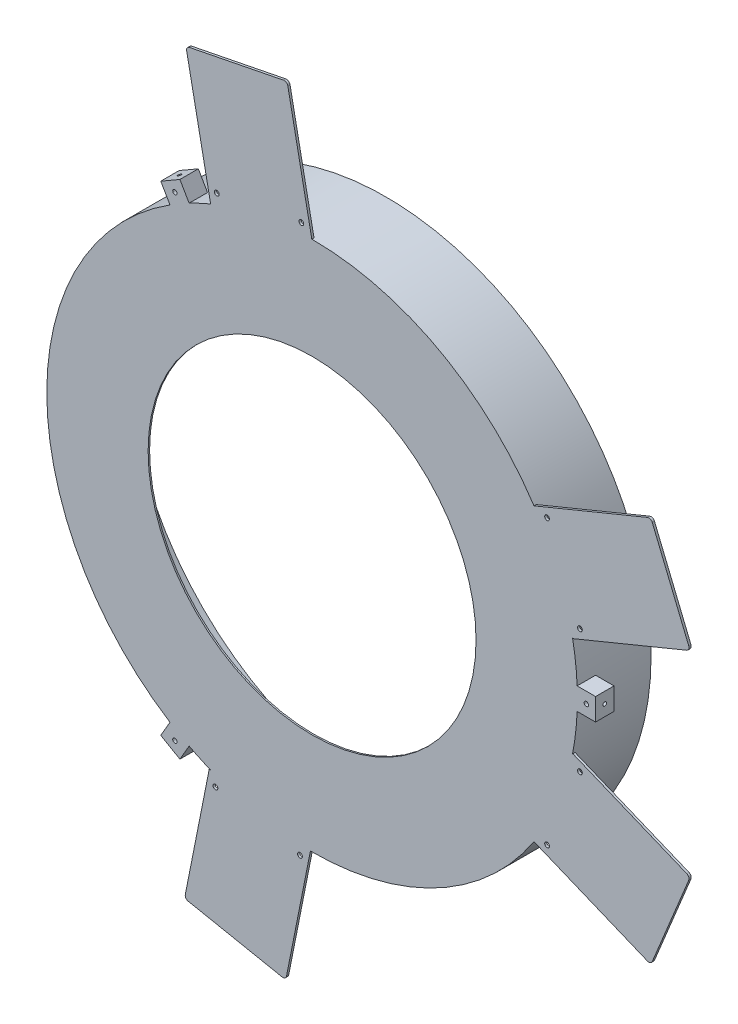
ISO-10303-21;
HEADER;
FILE_DESCRIPTION(('STEP AP214'),'2;1');
FILE_NAME('part.step','',(''),(''),'','','');
FILE_SCHEMA(('AUTOMOTIVE_DESIGN { 1 0 10303 214 1 1 1 1 }'));
ENDSEC;
DATA;
#1=APPLICATION_CONTEXT('core data for automotive mechanical design processes');
#2=APPLICATION_PROTOCOL_DEFINITION('international standard','automotive_design',2000,#1);
#3=PRODUCT_CONTEXT('',#1,'mechanical');
#4=PRODUCT('Part','Part','',(#3));
#5=PRODUCT_RELATED_PRODUCT_CATEGORY('part','',(#4));
#6=PRODUCT_DEFINITION_FORMATION('','',#4);
#7=PRODUCT_DEFINITION_CONTEXT('part definition',#1,'design');
#8=PRODUCT_DEFINITION('design','',#6,#7);
#9=PRODUCT_DEFINITION_SHAPE('','',#8);
#10=(LENGTH_UNIT() NAMED_UNIT(*) SI_UNIT(.MILLI.,.METRE.));
#11=(NAMED_UNIT(*) PLANE_ANGLE_UNIT() SI_UNIT($,.RADIAN.));
#12=(NAMED_UNIT(*) SI_UNIT($,.STERADIAN.) SOLID_ANGLE_UNIT());
#13=UNCERTAINTY_MEASURE_WITH_UNIT(LENGTH_MEASURE(1.E-05),#10,'distance_accuracy_value','');
#14=(GEOMETRIC_REPRESENTATION_CONTEXT(3) GLOBAL_UNCERTAINTY_ASSIGNED_CONTEXT((#13)) GLOBAL_UNIT_ASSIGNED_CONTEXT((#10,
#11,#12)) REPRESENTATION_CONTEXT('',''));
#15=CARTESIAN_POINT('',(0.,0.,0.));
#16=DIRECTION('',(0.,0.,1.));
#17=DIRECTION('',(1.,0.,0.));
#18=AXIS2_PLACEMENT_3D('',#15,#16,#17);
#19=CARTESIAN_POINT('',(0.,0.,100.));
#20=DIRECTION('',(0.,0.,-1.));
#21=DIRECTION('',(-1.,0.,0.));
#22=AXIS2_PLACEMENT_3D('',#19,#20,#21);
#23=CYLINDRICAL_SURFACE('',#22,360.);
#24=CARTESIAN_POINT('',(0.,0.,100.));
#25=DIRECTION('',(0.,0.,1.));
#26=DIRECTION('',(1.,0.,0.));
#27=AXIS2_PLACEMENT_3D('',#24,#25,#26);
#28=CIRCLE('',#27,360.);
#29=CARTESIAN_POINT('',(-166.853301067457,-318.998394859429,100.));
#30=VERTEX_POINT('',#29);
#31=CARTESIAN_POINT('',(-137.679364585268,-332.63251880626,100.));
#32=VERTEX_POINT('',#31);
#33=EDGE_CURVE('E311',#30,#32,#28,.T.);
#34=ORIENTED_EDGE('',*,*,#33,.F.);
#35=DIRECTION('',(0.,0.,1.));
#36=VECTOR('',#35,1.);
#37=CARTESIAN_POINT('',(-166.853301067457,-318.99839485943,75.));
#38=LINE('',#37,#36);
#39=CARTESIAN_POINT('',(-166.853301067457,-318.99839485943,75.));
#40=VERTEX_POINT('',#39);
#41=EDGE_CURVE('E309',#40,#30,#38,.T.);
#42=ORIENTED_EDGE('',*,*,#41,.F.);
#43=CARTESIAN_POINT('',(0.,0.,75.));
#44=DIRECTION('',(0.,0.,-1.));
#45=DIRECTION('',(-1.,0.,0.));
#46=AXIS2_PLACEMENT_3D('',#43,#44,#45);
#47=CIRCLE('',#46,360.);
#48=CARTESIAN_POINT('',(-192.834063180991,-303.99839485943,75.));
#49=VERTEX_POINT('',#48);
#50=EDGE_CURVE('E11',#40,#49,#47,.T.);
#51=ORIENTED_EDGE('',*,*,#50,.T.);
#52=DIRECTION('',(0.,0.,1.));
#53=VECTOR('',#52,1.);
#54=CARTESIAN_POINT('',(-192.834063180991,-303.99839485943,75.));
#55=LINE('',#54,#53);
#56=CARTESIAN_POINT('',(-192.834063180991,-303.99839485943,100.));
#57=VERTEX_POINT('',#56);
#58=EDGE_CURVE('E287',#49,#57,#55,.T.);
#59=ORIENTED_EDGE('',*,*,#58,.T.);
#60=CARTESIAN_POINT('',(-192.834063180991,303.99839485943,100.));
#61=VERTEX_POINT('',#60);
#62=EDGE_CURVE('E563',#61,#57,#28,.T.);
#63=ORIENTED_EDGE('',*,*,#62,.F.);
#64=DIRECTION('',(0.,0.,1.));
#65=VECTOR('',#64,1.);
#66=CARTESIAN_POINT('',(-192.834063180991,303.99839485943,75.));
#67=LINE('',#66,#65);
#68=CARTESIAN_POINT('',(-192.834063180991,303.99839485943,75.));
#69=VERTEX_POINT('',#68);
#70=EDGE_CURVE('E342',#69,#61,#67,.T.);
#71=ORIENTED_EDGE('',*,*,#70,.F.);
#72=CARTESIAN_POINT('',(0.,0.,75.));
#73=DIRECTION('',(0.,0.,1.));
#74=DIRECTION('',(1.,0.,0.));
#75=AXIS2_PLACEMENT_3D('',#72,#73,#74);
#76=CIRCLE('',#75,360.);
#77=CARTESIAN_POINT('',(-166.853301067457,318.998394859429,75.));
#78=VERTEX_POINT('',#77);
#79=EDGE_CURVE('E42',#78,#69,#76,.T.);
#80=ORIENTED_EDGE('',*,*,#79,.F.);
#81=DIRECTION('',(0.,0.,1.));
#82=VECTOR('',#81,1.);
#83=CARTESIAN_POINT('',(-166.853301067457,318.998394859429,75.));
#84=LINE('',#83,#82);
#85=CARTESIAN_POINT('',(-166.853301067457,318.998394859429,100.));
#86=VERTEX_POINT('',#85);
#87=EDGE_CURVE('E336',#78,#86,#84,.T.);
#88=ORIENTED_EDGE('',*,*,#87,.T.);
#89=CARTESIAN_POINT('',(-137.680834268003,332.631910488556,100.));
#90=VERTEX_POINT('',#89);
#91=EDGE_CURVE('E559',#90,#86,#28,.T.);
#92=ORIENTED_EDGE('',*,*,#91,.F.);
#93=DIRECTION('',(0.,0.,1.));
#94=VECTOR('',#93,1.);
#95=CARTESIAN_POINT('',(-137.680834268,332.631910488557,97.));
#96=LINE('',#95,#94);
#97=CARTESIAN_POINT('',(-137.680834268,332.631910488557,97.));
#98=VERTEX_POINT('',#97);
#99=EDGE_CURVE('E541',#98,#90,#96,.T.);
#100=ORIENTED_EDGE('',*,*,#99,.F.);
#101=CARTESIAN_POINT('',(0.,0.,97.));
#102=DIRECTION('',(0.,0.,1.));
#103=DIRECTION('',(1.,0.,0.));
#104=AXIS2_PLACEMENT_3D('',#101,#102,#103);
#105=CIRCLE('',#104,360.);
#106=CARTESIAN_POINT('',(-0.381859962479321,359.999797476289,97.));
#107=VERTEX_POINT('',#106);
#108=EDGE_CURVE('E538',#107,#98,#105,.T.);
#109=ORIENTED_EDGE('',*,*,#108,.F.);
#110=DIRECTION('',(0.,0.,1.));
#111=VECTOR('',#110,1.);
#112=CARTESIAN_POINT('',(-0.381859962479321,359.999797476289,97.));
#113=LINE('',#112,#111);
#114=CARTESIAN_POINT('',(-0.381859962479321,359.999797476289,100.));
#115=VERTEX_POINT('',#114);
#116=EDGE_CURVE('E553',#107,#115,#113,.T.);
#117=ORIENTED_EDGE('',*,*,#116,.T.);
#118=CARTESIAN_POINT('',(301.105882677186,197.320164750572,100.));
#119=VERTEX_POINT('',#118);
#120=EDGE_CURVE('E564',#119,#115,#28,.T.);
#121=ORIENTED_EDGE('',*,*,#120,.F.);
#122=DIRECTION('',(0.,0.,1.));
#123=VECTOR('',#122,1.);
#124=CARTESIAN_POINT('',(301.105882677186,197.320164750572,97.));
#125=LINE('',#124,#123);
#126=CARTESIAN_POINT('',(301.105882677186,197.320164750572,97.));
#127=VERTEX_POINT('',#126);
#128=EDGE_CURVE('E500',#127,#119,#125,.T.);
#129=ORIENTED_EDGE('',*,*,#128,.F.);
#130=CARTESIAN_POINT('',(0.,0.,97.));
#131=DIRECTION('',(0.,0.,1.));
#132=DIRECTION('',(1.,0.,0.));
#133=AXIS2_PLACEMENT_3D('',#130,#131,#132);
#134=CIRCLE('',#133,360.);
#135=CARTESIAN_POINT('',(353.247287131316,69.3999577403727,97.));
#136=VERTEX_POINT('',#135);
#137=EDGE_CURVE('E492',#136,#127,#134,.T.);
#138=ORIENTED_EDGE('',*,*,#137,.F.);
#139=DIRECTION('',(0.,0.,1.));
#140=VECTOR('',#139,1.);
#141=CARTESIAN_POINT('',(353.247287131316,69.3999577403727,97.));
#142=LINE('',#141,#140);
#143=CARTESIAN_POINT('',(353.247287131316,69.3999577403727,100.));
#144=VERTEX_POINT('',#143);
#145=EDGE_CURVE('E519',#136,#144,#142,.T.);
#146=ORIENTED_EDGE('',*,*,#145,.T.);
#147=CARTESIAN_POINT('',(359.687364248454,15.,100.));
#148=VERTEX_POINT('',#147);
#149=EDGE_CURVE('E651',#148,#144,#28,.T.);
#150=ORIENTED_EDGE('',*,*,#149,.F.);
#151=DIRECTION('',(0.,0.,1.));
#152=VECTOR('',#151,1.);
#153=CARTESIAN_POINT('',(359.687364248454,15.,75.));
#154=LINE('',#153,#152);
#155=CARTESIAN_POINT('',(359.687364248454,15.,75.));
#156=VERTEX_POINT('',#155);
#157=EDGE_CURVE('E374',#156,#148,#154,.T.);
#158=ORIENTED_EDGE('',*,*,#157,.F.);
#159=CARTESIAN_POINT('',(0.,0.,75.));
#160=DIRECTION('',(0.,0.,-1.));
#161=DIRECTION('',(-1.,0.,0.));
#162=AXIS2_PLACEMENT_3D('',#159,#160,#161);
#163=CIRCLE('',#162,360.);
#164=CARTESIAN_POINT('',(359.687364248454,-15.,75.));
#165=VERTEX_POINT('',#164);
#166=EDGE_CURVE('E638',#156,#165,#163,.T.);
#167=ORIENTED_EDGE('',*,*,#166,.T.);
#168=DIRECTION('',(0.,0.,1.));
#169=VECTOR('',#168,1.);
#170=CARTESIAN_POINT('',(359.687364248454,-15.,75.));
#171=LINE('',#170,#169);
#172=CARTESIAN_POINT('',(359.687364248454,-15.,100.));
#173=VERTEX_POINT('',#172);
#174=EDGE_CURVE('E367',#165,#173,#171,.T.);
#175=ORIENTED_EDGE('',*,*,#174,.T.);
#176=CARTESIAN_POINT('',(353.247287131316,-69.3999577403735,100.));
#177=VERTEX_POINT('',#176);
#178=EDGE_CURVE('E653',#177,#173,#28,.T.);
#179=ORIENTED_EDGE('',*,*,#178,.F.);
#180=DIRECTION('',(0.,0.,1.));
#181=VECTOR('',#180,1.);
#182=CARTESIAN_POINT('',(353.247287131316,-69.3999577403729,97.));
#183=LINE('',#182,#181);
#184=CARTESIAN_POINT('',(353.247287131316,-69.3999577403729,97.));
#185=VERTEX_POINT('',#184);
#186=EDGE_CURVE('E476',#185,#177,#183,.T.);
#187=ORIENTED_EDGE('',*,*,#186,.F.);
#188=CARTESIAN_POINT('',(0.,0.,97.));
#189=DIRECTION('',(0.,0.,1.));
#190=DIRECTION('',(1.,0.,0.));
#191=AXIS2_PLACEMENT_3D('',#188,#189,#190);
#192=CIRCLE('',#191,360.);
#193=CARTESIAN_POINT('',(301.105882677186,-197.320164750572,97.));
#194=VERTEX_POINT('',#193);
#195=EDGE_CURVE('E452',#194,#185,#192,.T.);
#196=ORIENTED_EDGE('',*,*,#195,.F.);
#197=DIRECTION('',(0.,0.,1.));
#198=VECTOR('',#197,1.);
#199=CARTESIAN_POINT('',(301.105882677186,-197.320164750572,97.));
#200=LINE('',#199,#198);
#201=CARTESIAN_POINT('',(301.105882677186,-197.320164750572,100.));
#202=VERTEX_POINT('',#201);
#203=EDGE_CURVE('E472',#194,#202,#200,.T.);
#204=ORIENTED_EDGE('',*,*,#203,.T.);
#205=CARTESIAN_POINT('',(-2.27729445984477,-359.992797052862,100.));
#206=VERTEX_POINT('',#205);
#207=EDGE_CURVE('E652',#206,#202,#28,.T.);
#208=ORIENTED_EDGE('',*,*,#207,.F.);
#209=DIRECTION('',(0.,0.,1.));
#210=VECTOR('',#209,1.);
#211=CARTESIAN_POINT('',(-2.27729445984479,-359.992797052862,97.));
#212=LINE('',#211,#210);
#213=CARTESIAN_POINT('',(-2.27729445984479,-359.992797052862,97.));
#214=VERTEX_POINT('',#213);
#215=EDGE_CURVE('E414',#214,#206,#212,.T.);
#216=ORIENTED_EDGE('',*,*,#215,.F.);
#217=CARTESIAN_POINT('',(0.,0.,97.));
#218=DIRECTION('',(0.,0.,1.));
#219=DIRECTION('',(1.,0.,0.));
#220=AXIS2_PLACEMENT_3D('',#217,#218,#219);
#221=CIRCLE('',#220,360.);
#222=CARTESIAN_POINT('',(-137.679364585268,-332.63251880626,97.));
#223=VERTEX_POINT('',#222);
#224=EDGE_CURVE('E406',#223,#214,#221,.T.);
#225=ORIENTED_EDGE('',*,*,#224,.F.);
#226=DIRECTION('',(0.,0.,1.));
#227=VECTOR('',#226,1.);
#228=CARTESIAN_POINT('',(-137.679364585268,-332.63251880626,97.));
#229=LINE('',#228,#227);
#230=EDGE_CURVE('E433',#223,#32,#229,.T.);
#231=ORIENTED_EDGE('',*,*,#230,.T.);
#232=EDGE_LOOP('',(#34,#42,#51,#59,#63,#71,#80,#88,#92,#100,#109,#117,#121,#129,#138,#146,#150,
#158,#167,#175,#179,#187,#196,#204,#208,#216,#225,#231));
#233=FACE_BOUND('',#232,.T.);
#234=CARTESIAN_POINT('',(0.,0.,0.));
#235=DIRECTION('',(0.,0.,1.));
#236=DIRECTION('',(1.,0.,0.));
#237=AXIS2_PLACEMENT_3D('',#234,#235,#236);
#238=CIRCLE('',#237,360.);
#239=CARTESIAN_POINT('',(360.,0.,0.));
#240=VERTEX_POINT('',#239);
#241=EDGE_CURVE('E556',#240,#240,#238,.T.);
#242=ORIENTED_EDGE('',*,*,#241,.T.);
#243=EDGE_LOOP('',(#242));
#244=FACE_BOUND('',#243,.T.);
#245=ADVANCED_FACE('F34',(#233,#244),#23,.T.);
#246=CARTESIAN_POINT('',(0.,0.,100.));
#247=DIRECTION('',(0.,0.,1.));
#248=DIRECTION('',(1.,0.,0.));
#249=AXIS2_PLACEMENT_3D('',#246,#247,#248);
#250=PLANE('',#249);
#251=ORIENTED_EDGE('',*,*,#62,.T.);
#252=DIRECTION('',(-0.499999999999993,-0.866025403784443,0.));
#253=VECTOR('',#252,1.);
#254=CARTESIAN_POINT('',(-205.33406318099,-325.649029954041,100.));
#255=LINE('',#254,#253);
#256=CARTESIAN_POINT('',(-205.33406318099,-325.649029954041,100.));
#257=VERTEX_POINT('',#256);
#258=EDGE_CURVE('E292',#57,#257,#255,.T.);
#259=ORIENTED_EDGE('',*,*,#258,.T.);
#260=DIRECTION('',(0.866025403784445,-0.499999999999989,0.));
#261=VECTOR('',#260,1.);
#262=CARTESIAN_POINT('',(-179.353301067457,-340.649029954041,100.));
#263=LINE('',#262,#261);
#264=CARTESIAN_POINT('',(-179.353301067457,-340.649029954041,100.));
#265=VERTEX_POINT('',#264);
#266=EDGE_CURVE('E1392',#257,#265,#263,.T.);
#267=ORIENTED_EDGE('',*,*,#266,.T.);
#268=DIRECTION('',(0.499999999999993,0.866025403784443,0.));
#269=VECTOR('',#268,1.);
#270=CARTESIAN_POINT('',(-166.853301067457,-318.99839485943,100.));
#271=LINE('',#270,#269);
#272=EDGE_CURVE('E49',#265,#30,#271,.T.);
#273=ORIENTED_EDGE('',*,*,#272,.T.);
#274=ORIENTED_EDGE('',*,*,#33,.T.);
#275=DIRECTION('',(-0.980810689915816,0.194962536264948,0.));
#276=VECTOR('',#275,1.);
#277=CARTESIAN_POINT('',(129.675226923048,-385.776443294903,100.));
#278=LINE('',#277,#276);
#279=CARTESIAN_POINT('',(-139.505680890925,-332.269489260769,100.));
#280=VERTEX_POINT('',#279);
#281=EDGE_CURVE('E425',#32,#280,#278,.T.);
#282=ORIENTED_EDGE('',*,*,#281,.T.);
#283=DIRECTION('',(0.194799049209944,0.980843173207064,0.));
#284=VECTOR('',#283,1.);
#285=CARTESIAN_POINT('',(-249.600514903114,-886.613911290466,100.));
#286=LINE('',#285,#284);
#287=CARTESIAN_POINT('',(-172.037122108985,-496.070299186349,100.));
#288=VERTEX_POINT('',#287);
#289=EDGE_CURVE('E398',#288,#280,#286,.T.);
#290=ORIENTED_EDGE('',*,*,#289,.F.);
#291=CARTESIAN_POINT('',(-167.13290624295,-497.044294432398,100.));
#292=DIRECTION('',(0.,0.,1.));
#293=DIRECTION('',(1.,0.,0.));
#294=AXIS2_PLACEMENT_3D('',#291,#292,#293);
#295=CIRCLE('',#294,5.);
#296=CARTESIAN_POINT('',(-168.106901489,-501.948510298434,100.));
#297=VERTEX_POINT('',#296);
#298=EDGE_CURVE('E583',#288,#297,#295,.T.);
#299=ORIENTED_EDGE('',*,*,#298,.T.);
#300=DIRECTION('',(-0.980843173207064,0.194799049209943,0.));
#301=VECTOR('',#300,1.);
#302=CARTESIAN_POINT('',(96.0863094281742,-554.418250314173,100.));
#303=LINE('',#302,#301);
#304=CARTESIAN_POINT('',(-40.5972889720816,-527.272386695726,100.));
#305=VERTEX_POINT('',#304);
#306=EDGE_CURVE('E420',#305,#297,#303,.T.);
#307=ORIENTED_EDGE('',*,*,#306,.F.);
#308=CARTESIAN_POINT('',(-39.6232937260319,-522.368170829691,100.));
#309=DIRECTION('',(0.,0.,1.));
#310=DIRECTION('',(1.,0.,0.));
#311=AXIS2_PLACEMENT_3D('',#308,#309,#310);
#312=CIRCLE('',#311,5.);
#313=CARTESIAN_POINT('',(-34.7190778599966,-523.342166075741,100.));
#314=VERTEX_POINT('',#313);
#315=EDGE_CURVE('E581',#305,#314,#312,.T.);
#316=ORIENTED_EDGE('',*,*,#315,.T.);
#317=DIRECTION('',(0.194799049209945,0.980843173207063,0.));
#318=VECTOR('',#317,1.);
#319=CARTESIAN_POINT('',(-112.282470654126,-913.885778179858,100.));
#320=LINE('',#319,#318);
#321=EDGE_CURVE('E423',#314,#206,#320,.T.);
#322=ORIENTED_EDGE('',*,*,#321,.T.);
#323=ORIENTED_EDGE('',*,*,#207,.T.);
#324=DIRECTION('',(-0.92476526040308,0.380538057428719,0.));
#325=VECTOR('',#324,1.);
#326=CARTESIAN_POINT('',(321.652026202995,-205.774839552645,100.));
#327=LINE('',#326,#325);
#328=CARTESIAN_POINT('',(455.116050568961,-260.694874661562,100.));
#329=VERTEX_POINT('',#328);
#330=EDGE_CURVE('E441',#329,#202,#327,.T.);
#331=ORIENTED_EDGE('',*,*,#330,.F.);
#332=CARTESIAN_POINT('',(457.018740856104,-256.071048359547,100.));
#333=DIRECTION('',(0.,0.,1.));
#334=DIRECTION('',(1.,0.,0.));
#335=AXIS2_PLACEMENT_3D('',#332,#333,#334);
#336=CIRCLE('',#335,5.);
#337=CARTESIAN_POINT('',(461.64256715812,-257.97373864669,100.));
#338=VERTEX_POINT('',#337);
#339=EDGE_CURVE('E579',#329,#338,#336,.T.);
#340=ORIENTED_EDGE('',*,*,#339,.T.);
#341=DIRECTION('',(0.38053805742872,0.92476526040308,0.));
#342=VECTOR('',#341,1.);
#343=CARTESIAN_POINT('',(157.584762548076,-996.880371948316,100.));
#344=LINE('',#343,#342);
#345=CARTESIAN_POINT('',(511.112514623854,-137.75425479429,100.));
#346=VERTEX_POINT('',#345);
#347=EDGE_CURVE('E463',#338,#346,#344,.T.);
#348=ORIENTED_EDGE('',*,*,#347,.T.);
#349=CARTESIAN_POINT('',(506.488688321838,-135.851564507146,100.));
#350=DIRECTION('',(0.,0.,1.));
#351=DIRECTION('',(1.,0.,0.));
#352=AXIS2_PLACEMENT_3D('',#349,#350,#351);
#353=CIRCLE('',#352,5.);
#354=CARTESIAN_POINT('',(508.391378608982,-131.227738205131,100.));
#355=VERTEX_POINT('',#354);
#356=EDGE_CURVE('E577',#346,#355,#353,.T.);
#357=ORIENTED_EDGE('',*,*,#356,.T.);
#358=DIRECTION('',(-0.92476526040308,0.380538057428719,0.));
#359=VECTOR('',#358,1.);
#360=CARTESIAN_POINT('',(374.927354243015,-76.3077030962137,100.));
#361=LINE('',#360,#359);
#362=CARTESIAN_POINT('',(353.955580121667,-67.6778826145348,100.));
#363=VERTEX_POINT('',#362);
#364=EDGE_CURVE('E466',#355,#363,#361,.T.);
#365=ORIENTED_EDGE('',*,*,#364,.T.);
#366=DIRECTION('',(0.380383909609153,0.924828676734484,0.));
#367=VECTOR('',#366,1.);
#368=CARTESIAN_POINT('',(-1.33231790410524,-931.490542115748,100.));
#369=LINE('',#368,#367);
#370=EDGE_CURVE('E468',#177,#363,#369,.T.);
#371=ORIENTED_EDGE('',*,*,#370,.F.);
#372=ORIENTED_EDGE('',*,*,#178,.T.);
#373=DIRECTION('',(1.,0.,0.));
#374=VECTOR('',#373,1.);
#375=CARTESIAN_POINT('',(359.687364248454,-15.,100.));
#376=LINE('',#375,#374);
#377=CARTESIAN_POINT('',(384.687364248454,-15.,100.));
#378=VERTEX_POINT('',#377);
#379=EDGE_CURVE('E354',#173,#378,#376,.T.);
#380=ORIENTED_EDGE('',*,*,#379,.T.);
#381=DIRECTION('',(0.,1.,0.));
#382=VECTOR('',#381,1.);
#383=CARTESIAN_POINT('',(384.687364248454,-15.,100.));
#384=LINE('',#383,#382);
#385=CARTESIAN_POINT('',(384.687364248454,15.,100.));
#386=VERTEX_POINT('',#385);
#387=EDGE_CURVE('E370',#378,#386,#384,.T.);
#388=ORIENTED_EDGE('',*,*,#387,.T.);
#389=DIRECTION('',(-1.,0.,0.));
#390=VECTOR('',#389,1.);
#391=CARTESIAN_POINT('',(384.687364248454,15.,100.));
#392=LINE('',#391,#390);
#393=EDGE_CURVE('E361',#386,#148,#392,.T.);
#394=ORIENTED_EDGE('',*,*,#393,.T.);
#395=ORIENTED_EDGE('',*,*,#149,.T.);
#396=DIRECTION('',(0.380383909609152,-0.924828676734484,0.));
#397=VECTOR('',#396,1.);
#398=CARTESIAN_POINT('',(660.073342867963,-676.587261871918,100.));
#399=LINE('',#398,#397);
#400=CARTESIAN_POINT('',(353.955580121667,67.6778826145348,100.));
#401=VERTEX_POINT('',#400);
#402=EDGE_CURVE('E511',#144,#401,#399,.T.);
#403=ORIENTED_EDGE('',*,*,#402,.T.);
#404=DIRECTION('',(-0.92476526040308,-0.380538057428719,0.));
#405=VECTOR('',#404,1.);
#406=CARTESIAN_POINT('',(-286.700964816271,-195.950313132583,100.));
#407=LINE('',#406,#405);
#408=CARTESIAN_POINT('',(508.391378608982,131.227738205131,100.));
#409=VERTEX_POINT('',#408);
#410=EDGE_CURVE('E484',#409,#401,#407,.T.);
#411=ORIENTED_EDGE('',*,*,#410,.F.);
#412=CARTESIAN_POINT('',(506.488688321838,135.851564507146,100.));
#413=DIRECTION('',(0.,0.,1.));
#414=DIRECTION('',(1.,0.,0.));
#415=AXIS2_PLACEMENT_3D('',#412,#413,#414);
#416=CIRCLE('',#415,5.);
#417=CARTESIAN_POINT('',(511.112514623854,137.75425479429,100.));
#418=VERTEX_POINT('',#417);
#419=EDGE_CURVE('E575',#409,#418,#416,.T.);
#420=ORIENTED_EDGE('',*,*,#419,.T.);
#421=DIRECTION('',(0.380538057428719,-0.92476526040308,0.));
#422=VECTOR('',#421,1.);
#423=CARTESIAN_POINT('',(819.213081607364,-610.976904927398,100.));
#424=LINE('',#423,#422);
#425=CARTESIAN_POINT('',(461.64256715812,257.97373864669,100.));
#426=VERTEX_POINT('',#425);
#427=EDGE_CURVE('E506',#426,#418,#424,.T.);
#428=ORIENTED_EDGE('',*,*,#427,.F.);
#429=CARTESIAN_POINT('',(457.018740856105,256.071048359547,100.));
#430=DIRECTION('',(0.,0.,1.));
#431=DIRECTION('',(1.,0.,0.));
#432=AXIS2_PLACEMENT_3D('',#429,#430,#431);
#433=CIRCLE('',#432,5.);
#434=CARTESIAN_POINT('',(455.116050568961,260.694874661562,100.));
#435=VERTEX_POINT('',#434);
#436=EDGE_CURVE('E573',#426,#435,#433,.T.);
#437=ORIENTED_EDGE('',*,*,#436,.T.);
#438=DIRECTION('',(-0.92476526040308,-0.380538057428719,0.));
#439=VECTOR('',#438,1.);
#440=CARTESIAN_POINT('',(-339.976292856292,-66.4831766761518,100.));
#441=LINE('',#440,#439);
#442=EDGE_CURVE('E509',#435,#119,#441,.T.);
#443=ORIENTED_EDGE('',*,*,#442,.T.);
#444=ORIENTED_EDGE('',*,*,#120,.T.);
#445=DIRECTION('',(0.19479904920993,-0.980843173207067,0.));
#446=VECTOR('',#445,1.);
#447=CARTESIAN_POINT('',(248.770961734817,-894.522979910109,100.));
#448=LINE('',#447,#446);
#449=CARTESIAN_POINT('',(-32.8942312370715,523.704587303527,100.));
#450=VERTEX_POINT('',#449);
#451=EDGE_CURVE('E547',#450,#115,#448,.T.);
#452=ORIENTED_EDGE('',*,*,#451,.F.);
#453=CARTESIAN_POINT('',(-37.7984471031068,522.730592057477,100.));
#454=DIRECTION('',(0.,0.,1.));
#455=DIRECTION('',(1.,0.,0.));
#456=AXIS2_PLACEMENT_3D('',#453,#454,#455);
#457=CIRCLE('',#456,5.);
#458=CARTESIAN_POINT('',(-38.7724423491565,527.634807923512,100.));
#459=VERTEX_POINT('',#458);
#460=EDGE_CURVE('E569',#450,#459,#457,.T.);
#461=ORIENTED_EDGE('',*,*,#460,.T.);
#462=DIRECTION('',(-0.980843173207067,-0.194799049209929,0.));
#463=VECTOR('',#462,1.);
#464=CARTESIAN_POINT('',(-263.142276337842,483.074136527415,100.));
#465=LINE('',#464,#463);
#466=CARTESIAN_POINT('',(-166.282054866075,502.310931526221,100.));
#467=VERTEX_POINT('',#466);
#468=EDGE_CURVE('E549',#459,#467,#465,.T.);
#469=ORIENTED_EDGE('',*,*,#468,.T.);
#470=CARTESIAN_POINT('',(-165.308059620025,497.406715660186,100.));
#471=DIRECTION('',(0.,0.,1.));
#472=DIRECTION('',(1.,0.,0.));
#473=AXIS2_PLACEMENT_3D('',#470,#471,#472);
#474=CIRCLE('',#473,5.);
#475=CARTESIAN_POINT('',(-170.212275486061,496.432720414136,100.));
#476=VERTEX_POINT('',#475);
#477=EDGE_CURVE('E571',#467,#476,#474,.T.);
#478=ORIENTED_EDGE('',*,*,#477,.T.);
#479=DIRECTION('',(0.194799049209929,-0.980843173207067,0.));
#480=VECTOR('',#479,1.);
#481=CARTESIAN_POINT('',(111.452917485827,-921.794846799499,100.));
#482=LINE('',#481,#480);
#483=EDGE_CURVE('E528',#476,#90,#482,.T.);
#484=ORIENTED_EDGE('',*,*,#483,.T.);
#485=ORIENTED_EDGE('',*,*,#91,.T.);
#486=DIRECTION('',(-0.499999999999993,0.866025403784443,0.));
#487=VECTOR('',#486,1.);
#488=CARTESIAN_POINT('',(-179.353301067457,340.649029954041,100.));
#489=LINE('',#488,#487);
#490=CARTESIAN_POINT('',(-179.353301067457,340.649029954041,100.));
#491=VERTEX_POINT('',#490);
#492=EDGE_CURVE('E325',#86,#491,#489,.T.);
#493=ORIENTED_EDGE('',*,*,#492,.T.);
#494=DIRECTION('',(-0.866025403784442,-0.499999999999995,0.));
#495=VECTOR('',#494,1.);
#496=CARTESIAN_POINT('',(-205.334063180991,325.649029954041,100.));
#497=LINE('',#496,#495);
#498=CARTESIAN_POINT('',(-205.334063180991,325.649029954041,100.));
#499=VERTEX_POINT('',#498);
#500=EDGE_CURVE('E339',#491,#499,#497,.T.);
#501=ORIENTED_EDGE('',*,*,#500,.T.);
#502=DIRECTION('',(0.499999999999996,-0.866025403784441,0.));
#503=VECTOR('',#502,1.);
#504=CARTESIAN_POINT('',(-192.834063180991,303.99839485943,100.));
#505=LINE('',#504,#503);
#506=EDGE_CURVE('E56',#499,#61,#505,.T.);
#507=ORIENTED_EDGE('',*,*,#506,.T.);
#508=EDGE_LOOP('',(#251,#259,#267,#273,#274,#282,#290,#299,#307,#316,#322,#323,#331,#340,#348,
#357,#365,#371,#372,#380,#388,#394,#395,#403,#411,#420,#428,#437,#443,#444,#452,#461,#469,#478,
#484,#485,#493,#501,#507));
#509=FACE_BOUND('',#508,.T.);
#510=CARTESIAN_POINT('',(0.,0.,100.));
#511=DIRECTION('',(0.,0.,1.));
#512=DIRECTION('',(1.,0.,0.));
#513=AXIS2_PLACEMENT_3D('',#510,#511,#512);
#514=CIRCLE('',#513,222.5);
#515=CARTESIAN_POINT('',(222.5,0.,100.));
#516=VERTEX_POINT('',#515);
#517=EDGE_CURVE('E377',#516,#516,#514,.T.);
#518=ORIENTED_EDGE('',*,*,#517,.F.);
#519=EDGE_LOOP('',(#518));
#520=FACE_BOUND('',#519,.T.);
#521=CARTESIAN_POINT('',(-14.5644722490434,372.376235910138,100.));
#522=DIRECTION('',(0.,0.,1.));
#523=DIRECTION('',(1.,0.,0.));
#524=AXIS2_PLACEMENT_3D('',#521,#522,#523);
#525=CIRCLE('',#524,3.25);
#526=CARTESIAN_POINT('',(-11.3144722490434,372.376235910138,100.));
#527=VERTEX_POINT('',#526);
#528=EDGE_CURVE('E518',#527,#527,#525,.T.);
#529=ORIENTED_EDGE('',*,*,#528,.F.);
#530=EDGE_LOOP('',(#529));
#531=FACE_BOUND('',#530,.T.);
#532=CARTESIAN_POINT('',(-129.32312351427,349.584747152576,100.));
#533=DIRECTION('',(0.,0.,1.));
#534=DIRECTION('',(1.,0.,0.));
#535=AXIS2_PLACEMENT_3D('',#532,#533,#534);
#536=CIRCLE('',#535,3.25000000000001);
#537=CARTESIAN_POINT('',(-126.07312351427,349.584747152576,100.));
#538=VERTEX_POINT('',#537);
#539=EDGE_CURVE('E544',#538,#538,#536,.T.);
#540=ORIENTED_EDGE('',*,*,#539,.F.);
#541=EDGE_LOOP('',(#540));
#542=FACE_BOUND('',#541,.T.);
#543=CARTESIAN_POINT('',(363.450871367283,84.0207539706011,100.));
#544=DIRECTION('',(0.,0.,1.));
#545=DIRECTION('',(1.,0.,0.));
#546=AXIS2_PLACEMENT_3D('',#543,#544,#545);
#547=CIRCLE('',#546,3.24999999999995);
#548=CARTESIAN_POINT('',(366.700871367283,84.0207539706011,100.));
#549=VERTEX_POINT('',#548);
#550=EDGE_CURVE('E475',#549,#549,#547,.T.);
#551=ORIENTED_EDGE('',*,*,#550,.F.);
#552=EDGE_LOOP('',(#551));
#553=FACE_BOUND('',#552,.T.);
#554=CARTESIAN_POINT('',(318.927918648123,192.218289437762,100.));
#555=DIRECTION('',(0.,0.,1.));
#556=DIRECTION('',(1.,0.,0.));
#557=AXIS2_PLACEMENT_3D('',#554,#555,#556);
#558=CIRCLE('',#557,3.24999999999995);
#559=CARTESIAN_POINT('',(322.177918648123,192.218289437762,100.));
#560=VERTEX_POINT('',#559);
#561=EDGE_CURVE('E503',#560,#560,#558,.T.);
#562=ORIENTED_EDGE('',*,*,#561,.F.);
#563=EDGE_LOOP('',(#562));
#564=FACE_BOUND('',#563,.T.);
#565=CARTESIAN_POINT('',(318.927918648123,-192.218289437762,100.));
#566=DIRECTION('',(0.,0.,1.));
#567=DIRECTION('',(1.,0.,0.));
#568=AXIS2_PLACEMENT_3D('',#565,#566,#567);
#569=CIRCLE('',#568,3.24999999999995);
#570=CARTESIAN_POINT('',(322.177918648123,-192.218289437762,100.));
#571=VERTEX_POINT('',#570);
#572=EDGE_CURVE('E432',#571,#571,#569,.T.);
#573=ORIENTED_EDGE('',*,*,#572,.F.);
#574=EDGE_LOOP('',(#573));
#575=FACE_BOUND('',#574,.T.);
#576=CARTESIAN_POINT('',(363.450871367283,-84.0207539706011,100.));
#577=DIRECTION('',(0.,0.,1.));
#578=DIRECTION('',(1.,0.,0.));
#579=AXIS2_PLACEMENT_3D('',#576,#577,#578);
#580=CIRCLE('',#579,3.24999999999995);
#581=CARTESIAN_POINT('',(366.700871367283,-84.0207539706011,100.));
#582=VERTEX_POINT('',#581);
#583=EDGE_CURVE('E460',#582,#582,#580,.T.);
#584=ORIENTED_EDGE('',*,*,#583,.F.);
#585=EDGE_LOOP('',(#584));
#586=FACE_BOUND('',#585,.T.);
#587=CARTESIAN_POINT('',(-131.147970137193,-349.222325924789,100.));
#588=DIRECTION('',(0.,0.,1.));
#589=DIRECTION('',(1.,0.,0.));
#590=AXIS2_PLACEMENT_3D('',#587,#588,#589);
#591=CIRCLE('',#590,3.25000000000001);
#592=CARTESIAN_POINT('',(-127.897970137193,-349.222325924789,100.));
#593=VERTEX_POINT('',#592);
#594=EDGE_CURVE('E390',#593,#593,#591,.T.);
#595=ORIENTED_EDGE('',*,*,#594,.F.);
#596=EDGE_LOOP('',(#595));
#597=FACE_BOUND('',#596,.T.);
#598=CARTESIAN_POINT('',(-16.3893188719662,-372.013814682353,100.));
#599=DIRECTION('',(0.,0.,1.));
#600=DIRECTION('',(1.,0.,0.));
#601=AXIS2_PLACEMENT_3D('',#598,#599,#600);
#602=CIRCLE('',#601,3.25);
#603=CARTESIAN_POINT('',(-13.1393188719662,-372.013814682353,100.));
#604=VERTEX_POINT('',#603);
#605=EDGE_CURVE('E417',#604,#604,#602,.T.);
#606=ORIENTED_EDGE('',*,*,#605,.F.);
#607=EDGE_LOOP('',(#606));
#608=FACE_BOUND('',#607,.T.);
#609=CARTESIAN_POINT('',(372.187364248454,0.,100.));
#610=DIRECTION('',(0.,0.,1.));
#611=DIRECTION('',(1.,0.,0.));
#612=AXIS2_PLACEMENT_3D('',#609,#610,#611);
#613=CIRCLE('',#612,2.99999999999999);
#614=CARTESIAN_POINT('',(375.187364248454,0.,100.));
#615=VERTEX_POINT('',#614);
#616=EDGE_CURVE('E344',#615,#615,#613,.T.);
#617=ORIENTED_EDGE('',*,*,#616,.F.);
#618=EDGE_LOOP('',(#617));
#619=FACE_BOUND('',#618,.T.);
#620=CARTESIAN_POINT('',(-186.093682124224,322.323712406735,100.));
#621=DIRECTION('',(0.,0.,1.));
#622=DIRECTION('',(-1.,0.,0.));
#623=AXIS2_PLACEMENT_3D('',#620,#621,#622);
#624=CIRCLE('',#623,3.00000000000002);
#625=CARTESIAN_POINT('',(-189.093682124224,322.323712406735,100.));
#626=VERTEX_POINT('',#625);
#627=EDGE_CURVE('E313',#626,#626,#624,.T.);
#628=ORIENTED_EDGE('',*,*,#627,.F.);
#629=EDGE_LOOP('',(#628));
#630=FACE_BOUND('',#629,.T.);
#631=CARTESIAN_POINT('',(-186.093682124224,-322.323712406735,100.));
#632=DIRECTION('',(0.,0.,1.));
#633=DIRECTION('',(-1.,0.,0.));
#634=AXIS2_PLACEMENT_3D('',#631,#632,#633);
#635=CIRCLE('',#634,3.00000000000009);
#636=CARTESIAN_POINT('',(-189.093682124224,-322.323712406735,100.));
#637=VERTEX_POINT('',#636);
#638=EDGE_CURVE('E1378',#637,#637,#635,.T.);
#639=ORIENTED_EDGE('',*,*,#638,.F.);
#640=EDGE_LOOP('',(#639));
#641=FACE_BOUND('',#640,.T.);
#642=ADVANCED_FACE('F661',(#509,#520,#531,#542,#553,#564,#575,#586,#597,#608,#619,#630,#641),
#250,.T.);
#643=CARTESIAN_POINT('',(0.,0.,0.));
#644=DIRECTION('',(0.,0.,1.));
#645=DIRECTION('',(1.,0.,0.));
#646=AXIS2_PLACEMENT_3D('',#643,#644,#645);
#647=PLANE('',#646);
#648=CARTESIAN_POINT('',(0.,0.,0.));
#649=DIRECTION('',(0.,0.,-1.));
#650=DIRECTION('',(-1.,0.,0.));
#651=AXIS2_PLACEMENT_3D('',#648,#649,#650);
#652=CIRCLE('',#651,350.526132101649);
#653=CARTESIAN_POINT('',(-350.526132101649,0.,0.));
#654=VERTEX_POINT('',#653);
#655=EDGE_CURVE('E391',#654,#654,#652,.T.);
#656=ORIENTED_EDGE('',*,*,#655,.F.);
#657=EDGE_LOOP('',(#656));
#658=FACE_BOUND('',#657,.T.);
#659=ORIENTED_EDGE('',*,*,#241,.F.);
#660=EDGE_LOOP('',(#659));
#661=FACE_BOUND('',#660,.T.);
#662=ADVANCED_FACE('F747',(#658,#661),#647,.F.);
#663=CARTESIAN_POINT('',(248.770961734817,-894.522979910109,97.));
#664=DIRECTION('',(-0.980843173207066,-0.19479904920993,0.));
#665=DIRECTION('',(0.19479904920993,-0.980843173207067,0.));
#666=AXIS2_PLACEMENT_3D('',#663,#664,#665);
#667=PLANE('',#666);
#668=DIRECTION('',(0.19479904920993,-0.980843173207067,0.));
#669=VECTOR('',#668,1.);
#670=CARTESIAN_POINT('',(248.770961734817,-894.522979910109,97.));
#671=LINE('',#670,#669);
#672=CARTESIAN_POINT('',(-32.8942312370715,523.704587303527,97.));
#673=VERTEX_POINT('',#672);
#674=EDGE_CURVE('E531',#673,#107,#671,.T.);
#675=ORIENTED_EDGE('',*,*,#674,.F.);
#676=DIRECTION('',(0.,0.,1.));
#677=VECTOR('',#676,1.);
#678=CARTESIAN_POINT('',(-32.8942312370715,523.704587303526,100.));
#679=LINE('',#678,#677);
#680=EDGE_CURVE('E635',#673,#450,#679,.T.);
#681=ORIENTED_EDGE('',*,*,#680,.T.);
#682=ORIENTED_EDGE('',*,*,#451,.T.);
#683=ORIENTED_EDGE('',*,*,#116,.F.);
#684=EDGE_LOOP('',(#675,#681,#682,#683));
#685=FACE_BOUND('',#684,.T.);
#686=ADVANCED_FACE('F856',(#685),#667,.F.);
#687=CARTESIAN_POINT('',(111.452917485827,-921.794846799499,97.));
#688=DIRECTION('',(-0.980843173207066,-0.194799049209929,0.));
#689=DIRECTION('',(0.194799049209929,-0.980843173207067,0.));
#690=AXIS2_PLACEMENT_3D('',#687,#688,#689);
#691=PLANE('',#690);
#692=ORIENTED_EDGE('',*,*,#483,.F.);
#693=DIRECTION('',(0.,0.,1.));
#694=VECTOR('',#693,1.);
#695=CARTESIAN_POINT('',(-170.212275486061,496.432720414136,97.));
#696=LINE('',#695,#694);
#697=CARTESIAN_POINT('',(-170.212275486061,496.432720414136,97.));
#698=VERTEX_POINT('',#697);
#699=EDGE_CURVE('E629',#476,#698,#696,.F.);
#700=ORIENTED_EDGE('',*,*,#699,.T.);
#701=DIRECTION('',(0.194799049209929,-0.980843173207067,0.));
#702=VECTOR('',#701,1.);
#703=CARTESIAN_POINT('',(111.452917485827,-921.794846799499,97.));
#704=LINE('',#703,#702);
#705=EDGE_CURVE('E536',#698,#98,#704,.T.);
#706=ORIENTED_EDGE('',*,*,#705,.T.);
#707=ORIENTED_EDGE('',*,*,#99,.T.);
#708=EDGE_LOOP('',(#692,#700,#706,#707));
#709=FACE_BOUND('',#708,.T.);
#710=ADVANCED_FACE('F860',(#709),#691,.T.);
#711=CARTESIAN_POINT('',(-129.32312351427,349.584747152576,97.));
#712=DIRECTION('',(0.,0.,1.));
#713=DIRECTION('',(1.,0.,0.));
#714=AXIS2_PLACEMENT_3D('',#711,#712,#713);
#715=CYLINDRICAL_SURFACE('',#714,3.25000000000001);
#716=CARTESIAN_POINT('',(-129.32312351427,349.584747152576,97.));
#717=DIRECTION('',(0.,0.,1.));
#718=DIRECTION('',(1.,0.,0.));
#719=AXIS2_PLACEMENT_3D('',#716,#717,#718);
#720=CIRCLE('',#719,3.25000000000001);
#721=CARTESIAN_POINT('',(-126.07312351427,349.584747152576,97.));
#722=VERTEX_POINT('',#721);
#723=EDGE_CURVE('E527',#722,#722,#720,.T.);
#724=ORIENTED_EDGE('',*,*,#723,.F.);
#725=EDGE_LOOP('',(#724));
#726=FACE_BOUND('',#725,.T.);
#727=ORIENTED_EDGE('',*,*,#539,.T.);
#728=EDGE_LOOP('',(#727));
#729=FACE_BOUND('',#728,.T.);
#730=ADVANCED_FACE('F897',(#726,#729),#715,.F.);
#731=CARTESIAN_POINT('',(-14.5644722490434,372.376235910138,97.));
#732=DIRECTION('',(0.,0.,1.));
#733=DIRECTION('',(1.,0.,0.));
#734=AXIS2_PLACEMENT_3D('',#731,#732,#733);
#735=CYLINDRICAL_SURFACE('',#734,3.25);
#736=CARTESIAN_POINT('',(-14.5644722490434,372.376235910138,97.));
#737=DIRECTION('',(0.,0.,1.));
#738=DIRECTION('',(1.,0.,0.));
#739=AXIS2_PLACEMENT_3D('',#736,#737,#738);
#740=CIRCLE('',#739,3.25);
#741=CARTESIAN_POINT('',(-11.3144722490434,372.376235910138,97.));
#742=VERTEX_POINT('',#741);
#743=EDGE_CURVE('E524',#742,#742,#740,.T.);
#744=ORIENTED_EDGE('',*,*,#743,.F.);
#745=EDGE_LOOP('',(#744));
#746=FACE_BOUND('',#745,.T.);
#747=ORIENTED_EDGE('',*,*,#528,.T.);
#748=EDGE_LOOP('',(#747));
#749=FACE_BOUND('',#748,.T.);
#750=ADVANCED_FACE('F884',(#746,#749),#735,.F.);
#751=CARTESIAN_POINT('',(-263.142276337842,483.074136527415,97.));
#752=DIRECTION('',(-0.194799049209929,0.980843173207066,0.));
#753=DIRECTION('',(-0.980843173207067,-0.194799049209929,0.));
#754=AXIS2_PLACEMENT_3D('',#751,#752,#753);
#755=PLANE('',#754);
#756=DIRECTION('',(-0.980843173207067,-0.194799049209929,0.));
#757=VECTOR('',#756,1.);
#758=CARTESIAN_POINT('',(-263.142276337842,483.074136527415,97.));
#759=LINE('',#758,#757);
#760=CARTESIAN_POINT('',(-38.7724423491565,527.634807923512,97.));
#761=VERTEX_POINT('',#760);
#762=CARTESIAN_POINT('',(-166.282054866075,502.310931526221,97.));
#763=VERTEX_POINT('',#762);
#764=EDGE_CURVE('E533',#761,#763,#759,.T.);
#765=ORIENTED_EDGE('',*,*,#764,.T.);
#766=DIRECTION('',(0.,0.,1.));
#767=VECTOR('',#766,1.);
#768=CARTESIAN_POINT('',(-166.282054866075,502.310931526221,97.));
#769=LINE('',#768,#767);
#770=EDGE_CURVE('E626',#763,#467,#769,.T.);
#771=ORIENTED_EDGE('',*,*,#770,.T.);
#772=ORIENTED_EDGE('',*,*,#468,.F.);
#773=DIRECTION('',(0.,0.,1.));
#774=VECTOR('',#773,1.);
#775=CARTESIAN_POINT('',(-38.7724423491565,527.634807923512,97.));
#776=LINE('',#775,#774);
#777=EDGE_CURVE('E624',#459,#761,#776,.F.);
#778=ORIENTED_EDGE('',*,*,#777,.T.);
#779=EDGE_LOOP('',(#765,#771,#772,#778));
#780=FACE_BOUND('',#779,.T.);
#781=ADVANCED_FACE('F880',(#780),#755,.T.);
#782=CARTESIAN_POINT('',(19.4969118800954,-940.057646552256,97.));
#783=DIRECTION('',(0.,0.,1.));
#784=DIRECTION('',(1.,0.,0.));
#785=AXIS2_PLACEMENT_3D('',#782,#783,#784);
#786=PLANE('',#785);
#787=ORIENTED_EDGE('',*,*,#743,.T.);
#788=EDGE_LOOP('',(#787));
#789=FACE_BOUND('',#788,.T.);
#790=ORIENTED_EDGE('',*,*,#723,.T.);
#791=EDGE_LOOP('',(#790));
#792=FACE_BOUND('',#791,.T.);
#793=ORIENTED_EDGE('',*,*,#705,.F.);
#794=CARTESIAN_POINT('',(-165.308059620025,497.406715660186,97.));
#795=DIRECTION('',(0.,0.,1.));
#796=DIRECTION('',(1.,0.,0.));
#797=AXIS2_PLACEMENT_3D('',#794,#795,#796);
#798=CIRCLE('',#797,5.);
#799=EDGE_CURVE('E633',#698,#763,#798,.F.);
#800=ORIENTED_EDGE('',*,*,#799,.T.);
#801=ORIENTED_EDGE('',*,*,#764,.F.);
#802=CARTESIAN_POINT('',(-37.7984471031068,522.730592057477,97.));
#803=DIRECTION('',(0.,0.,1.));
#804=DIRECTION('',(1.,0.,0.));
#805=AXIS2_PLACEMENT_3D('',#802,#803,#804);
#806=CIRCLE('',#805,5.);
#807=EDGE_CURVE('E631',#761,#673,#806,.F.);
#808=ORIENTED_EDGE('',*,*,#807,.T.);
#809=ORIENTED_EDGE('',*,*,#674,.T.);
#810=ORIENTED_EDGE('',*,*,#108,.T.);
#811=EDGE_LOOP('',(#793,#800,#801,#808,#809,#810));
#812=FACE_BOUND('',#811,.T.);
#813=ADVANCED_FACE('F831',(#789,#792,#812),#786,.F.);
#814=CARTESIAN_POINT('',(819.213081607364,-610.976904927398,97.));
#815=DIRECTION('',(-0.924765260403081,-0.380538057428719,0.));
#816=DIRECTION('',(0.380538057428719,-0.924765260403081,0.));
#817=AXIS2_PLACEMENT_3D('',#814,#815,#816);
#818=PLANE('',#817);
#819=ORIENTED_EDGE('',*,*,#427,.T.);
#820=DIRECTION('',(0.,0.,1.));
#821=VECTOR('',#820,1.);
#822=CARTESIAN_POINT('',(511.112514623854,137.75425479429,97.));
#823=LINE('',#822,#821);
#824=CARTESIAN_POINT('',(511.112514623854,137.75425479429,97.));
#825=VERTEX_POINT('',#824);
#826=EDGE_CURVE('E616',#418,#825,#823,.F.);
#827=ORIENTED_EDGE('',*,*,#826,.T.);
#828=DIRECTION('',(0.380538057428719,-0.92476526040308,0.));
#829=VECTOR('',#828,1.);
#830=CARTESIAN_POINT('',(819.213081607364,-610.976904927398,97.));
#831=LINE('',#830,#829);
#832=CARTESIAN_POINT('',(461.64256715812,257.97373864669,97.));
#833=VERTEX_POINT('',#832);
#834=EDGE_CURVE('E487',#833,#825,#831,.T.);
#835=ORIENTED_EDGE('',*,*,#834,.F.);
#836=DIRECTION('',(0.,0.,1.));
#837=VECTOR('',#836,1.);
#838=CARTESIAN_POINT('',(461.64256715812,257.97373864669,100.));
#839=LINE('',#838,#837);
#840=EDGE_CURVE('E613',#833,#426,#839,.T.);
#841=ORIENTED_EDGE('',*,*,#840,.T.);
#842=EDGE_LOOP('',(#819,#827,#835,#841));
#843=FACE_BOUND('',#842,.T.);
#844=ADVANCED_FACE('F727',(#843),#818,.F.);
#845=CARTESIAN_POINT('',(-286.700964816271,-195.950313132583,97.));
#846=DIRECTION('',(-0.380538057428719,0.924765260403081,0.));
#847=DIRECTION('',(-0.924765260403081,-0.380538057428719,0.));
#848=AXIS2_PLACEMENT_3D('',#845,#846,#847);
#849=PLANE('',#848);
#850=DIRECTION('',(-0.92476526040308,-0.380538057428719,0.));
#851=VECTOR('',#850,1.);
#852=CARTESIAN_POINT('',(-286.700964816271,-195.950313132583,97.));
#853=LINE('',#852,#851);
#854=CARTESIAN_POINT('',(508.391378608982,131.227738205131,97.));
#855=VERTEX_POINT('',#854);
#856=CARTESIAN_POINT('',(353.955580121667,67.6778826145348,97.));
#857=VERTEX_POINT('',#856);
#858=EDGE_CURVE('E498',#855,#857,#853,.T.);
#859=ORIENTED_EDGE('',*,*,#858,.F.);
#860=DIRECTION('',(0.,0.,1.));
#861=VECTOR('',#860,1.);
#862=CARTESIAN_POINT('',(508.391378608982,131.227738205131,97.));
#863=LINE('',#862,#861);
#864=EDGE_CURVE('E610',#855,#409,#863,.T.);
#865=ORIENTED_EDGE('',*,*,#864,.T.);
#866=ORIENTED_EDGE('',*,*,#410,.T.);
#867=DIRECTION('',(0.,0.,1.));
#868=VECTOR('',#867,1.);
#869=CARTESIAN_POINT('',(353.955580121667,67.6778826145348,97.));
#870=LINE('',#869,#868);
#871=EDGE_CURVE('E515',#857,#401,#870,.T.);
#872=ORIENTED_EDGE('',*,*,#871,.F.);
#873=EDGE_LOOP('',(#859,#865,#866,#872));
#874=FACE_BOUND('',#873,.T.);
#875=ADVANCED_FACE('F721',(#874),#849,.F.);
#876=CARTESIAN_POINT('',(660.073342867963,-676.587261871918,97.));
#877=DIRECTION('',(-0.924828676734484,-0.380383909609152,0.));
#878=DIRECTION('',(0.380383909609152,-0.924828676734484,0.));
#879=AXIS2_PLACEMENT_3D('',#876,#877,#878);
#880=PLANE('',#879);
#881=ORIENTED_EDGE('',*,*,#402,.F.);
#882=ORIENTED_EDGE('',*,*,#145,.F.);
#883=DIRECTION('',(0.380383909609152,-0.924828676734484,0.));
#884=VECTOR('',#883,1.);
#885=CARTESIAN_POINT('',(660.073342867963,-676.587261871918,97.));
#886=LINE('',#885,#884);
#887=EDGE_CURVE('E495',#136,#857,#886,.T.);
#888=ORIENTED_EDGE('',*,*,#887,.T.);
#889=ORIENTED_EDGE('',*,*,#871,.T.);
#890=EDGE_LOOP('',(#881,#882,#888,#889));
#891=FACE_BOUND('',#890,.T.);
#892=ADVANCED_FACE('F712',(#891),#880,.T.);
#893=CARTESIAN_POINT('',(318.927918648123,192.218289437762,97.));
#894=DIRECTION('',(0.,0.,1.));
#895=DIRECTION('',(1.,0.,0.));
#896=AXIS2_PLACEMENT_3D('',#893,#894,#895);
#897=CYLINDRICAL_SURFACE('',#896,3.24999999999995);
#898=CARTESIAN_POINT('',(318.927918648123,192.218289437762,97.));
#899=DIRECTION('',(0.,0.,1.));
#900=DIRECTION('',(1.,0.,0.));
#901=AXIS2_PLACEMENT_3D('',#898,#899,#900);
#902=CIRCLE('',#901,3.24999999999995);
#903=CARTESIAN_POINT('',(322.177918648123,192.218289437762,97.));
#904=VERTEX_POINT('',#903);
#905=EDGE_CURVE('E483',#904,#904,#902,.T.);
#906=ORIENTED_EDGE('',*,*,#905,.F.);
#907=EDGE_LOOP('',(#906));
#908=FACE_BOUND('',#907,.T.);
#909=ORIENTED_EDGE('',*,*,#561,.T.);
#910=EDGE_LOOP('',(#909));
#911=FACE_BOUND('',#910,.T.);
#912=ADVANCED_FACE('F995',(#908,#911),#897,.F.);
#913=CARTESIAN_POINT('',(363.450871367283,84.0207539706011,97.));
#914=DIRECTION('',(0.,0.,1.));
#915=DIRECTION('',(1.,0.,0.));
#916=AXIS2_PLACEMENT_3D('',#913,#914,#915);
#917=CYLINDRICAL_SURFACE('',#916,3.24999999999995);
#918=CARTESIAN_POINT('',(363.450871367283,84.0207539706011,97.));
#919=DIRECTION('',(0.,0.,1.));
#920=DIRECTION('',(1.,0.,0.));
#921=AXIS2_PLACEMENT_3D('',#918,#919,#920);
#922=CIRCLE('',#921,3.24999999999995);
#923=CARTESIAN_POINT('',(366.700871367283,84.0207539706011,97.));
#924=VERTEX_POINT('',#923);
#925=EDGE_CURVE('E480',#924,#924,#922,.T.);
#926=ORIENTED_EDGE('',*,*,#925,.F.);
#927=EDGE_LOOP('',(#926));
#928=FACE_BOUND('',#927,.T.);
#929=ORIENTED_EDGE('',*,*,#550,.T.);
#930=EDGE_LOOP('',(#929));
#931=FACE_BOUND('',#930,.T.);
#932=ADVANCED_FACE('F847',(#928,#931),#917,.F.);
#933=CARTESIAN_POINT('',(-339.976292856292,-66.4831766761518,97.));
#934=DIRECTION('',(-0.380538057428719,0.924765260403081,0.));
#935=DIRECTION('',(-0.924765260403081,-0.380538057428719,0.));
#936=AXIS2_PLACEMENT_3D('',#933,#934,#935);
#937=PLANE('',#936);
#938=ORIENTED_EDGE('',*,*,#442,.F.);
#939=DIRECTION('',(0.,0.,1.));
#940=VECTOR('',#939,1.);
#941=CARTESIAN_POINT('',(455.116050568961,260.694874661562,97.));
#942=LINE('',#941,#940);
#943=CARTESIAN_POINT('',(455.116050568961,260.694874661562,97.));
#944=VERTEX_POINT('',#943);
#945=EDGE_CURVE('E622',#435,#944,#942,.F.);
#946=ORIENTED_EDGE('',*,*,#945,.T.);
#947=DIRECTION('',(-0.92476526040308,-0.380538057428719,0.));
#948=VECTOR('',#947,1.);
#949=CARTESIAN_POINT('',(-339.976292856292,-66.4831766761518,97.));
#950=LINE('',#949,#948);
#951=EDGE_CURVE('E490',#944,#127,#950,.T.);
#952=ORIENTED_EDGE('',*,*,#951,.T.);
#953=ORIENTED_EDGE('',*,*,#128,.T.);
#954=EDGE_LOOP('',(#938,#946,#952,#953));
#955=FACE_BOUND('',#954,.T.);
#956=ADVANCED_FACE('F844',(#955),#937,.T.);
#957=CARTESIAN_POINT('',(19.4969118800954,-940.057646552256,97.));
#958=DIRECTION('',(0.,0.,1.));
#959=DIRECTION('',(1.,0.,0.));
#960=AXIS2_PLACEMENT_3D('',#957,#958,#959);
#961=PLANE('',#960);
#962=ORIENTED_EDGE('',*,*,#925,.T.);
#963=EDGE_LOOP('',(#962));
#964=FACE_BOUND('',#963,.T.);
#965=ORIENTED_EDGE('',*,*,#905,.T.);
#966=EDGE_LOOP('',(#965));
#967=FACE_BOUND('',#966,.T.);
#968=ORIENTED_EDGE('',*,*,#834,.T.);
#969=CARTESIAN_POINT('',(506.488688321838,135.851564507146,97.));
#970=DIRECTION('',(0.,0.,1.));
#971=DIRECTION('',(1.,0.,0.));
#972=AXIS2_PLACEMENT_3D('',#969,#970,#971);
#973=CIRCLE('',#972,5.);
#974=EDGE_CURVE('E620',#825,#855,#973,.F.);
#975=ORIENTED_EDGE('',*,*,#974,.T.);
#976=ORIENTED_EDGE('',*,*,#858,.T.);
#977=ORIENTED_EDGE('',*,*,#887,.F.);
#978=ORIENTED_EDGE('',*,*,#137,.T.);
#979=ORIENTED_EDGE('',*,*,#951,.F.);
#980=CARTESIAN_POINT('',(457.018740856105,256.071048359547,97.));
#981=DIRECTION('',(0.,0.,1.));
#982=DIRECTION('',(1.,0.,0.));
#983=AXIS2_PLACEMENT_3D('',#980,#981,#982);
#984=CIRCLE('',#983,5.);
#985=EDGE_CURVE('E618',#944,#833,#984,.F.);
#986=ORIENTED_EDGE('',*,*,#985,.T.);
#987=EDGE_LOOP('',(#968,#975,#976,#977,#978,#979,#986));
#988=FACE_BOUND('',#987,.T.);
#989=ADVANCED_FACE('F714',(#964,#967,#988),#961,.F.);
#990=CARTESIAN_POINT('',(157.584762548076,-996.880371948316,97.));
#991=DIRECTION('',(0.92476526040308,-0.38053805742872,0.));
#992=DIRECTION('',(0.38053805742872,0.92476526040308,0.));
#993=AXIS2_PLACEMENT_3D('',#990,#991,#992);
#994=PLANE('',#993);
#995=ORIENTED_EDGE('',*,*,#347,.F.);
#996=DIRECTION('',(0.,0.,1.));
#997=VECTOR('',#996,1.);
#998=CARTESIAN_POINT('',(461.64256715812,-257.97373864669,97.));
#999=LINE('',#998,#997);
#1000=CARTESIAN_POINT('',(461.64256715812,-257.97373864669,97.));
#1001=VERTEX_POINT('',#1000);
#1002=EDGE_CURVE('E602',#338,#1001,#999,.F.);
#1003=ORIENTED_EDGE('',*,*,#1002,.T.);
#1004=DIRECTION('',(0.38053805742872,0.92476526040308,0.));
#1005=VECTOR('',#1004,1.);
#1006=CARTESIAN_POINT('',(157.584762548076,-996.880371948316,97.));
#1007=LINE('',#1006,#1005);
#1008=CARTESIAN_POINT('',(511.112514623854,-137.75425479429,97.));
#1009=VERTEX_POINT('',#1008);
#1010=EDGE_CURVE('E444',#1001,#1009,#1007,.T.);
#1011=ORIENTED_EDGE('',*,*,#1010,.T.);
#1012=DIRECTION('',(0.,0.,1.));
#1013=VECTOR('',#1012,1.);
#1014=CARTESIAN_POINT('',(511.112514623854,-137.75425479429,97.));
#1015=LINE('',#1014,#1013);
#1016=EDGE_CURVE('E599',#1009,#346,#1015,.T.);
#1017=ORIENTED_EDGE('',*,*,#1016,.T.);
#1018=EDGE_LOOP('',(#995,#1003,#1011,#1017));
#1019=FACE_BOUND('',#1018,.T.);
#1020=ADVANCED_FACE('F678',(#1019),#994,.T.);
#1021=CARTESIAN_POINT('',(321.652026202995,-205.774839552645,97.));
#1022=DIRECTION('',(0.380538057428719,0.924765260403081,0.));
#1023=DIRECTION('',(-0.924765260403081,0.380538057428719,0.));
#1024=AXIS2_PLACEMENT_3D('',#1021,#1022,#1023);
#1025=PLANE('',#1024);
#1026=DIRECTION('',(-0.92476526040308,0.380538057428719,0.));
#1027=VECTOR('',#1026,1.);
#1028=CARTESIAN_POINT('',(321.652026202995,-205.774839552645,97.));
#1029=LINE('',#1028,#1027);
#1030=CARTESIAN_POINT('',(455.116050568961,-260.694874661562,97.));
#1031=VERTEX_POINT('',#1030);
#1032=EDGE_CURVE('E455',#1031,#194,#1029,.T.);
#1033=ORIENTED_EDGE('',*,*,#1032,.F.);
#1034=DIRECTION('',(0.,0.,1.));
#1035=VECTOR('',#1034,1.);
#1036=CARTESIAN_POINT('',(455.116050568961,-260.694874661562,100.));
#1037=LINE('',#1036,#1035);
#1038=EDGE_CURVE('E596',#1031,#329,#1037,.T.);
#1039=ORIENTED_EDGE('',*,*,#1038,.T.);
#1040=ORIENTED_EDGE('',*,*,#330,.T.);
#1041=ORIENTED_EDGE('',*,*,#203,.F.);
#1042=EDGE_LOOP('',(#1033,#1039,#1040,#1041));
#1043=FACE_BOUND('',#1042,.T.);
#1044=ADVANCED_FACE('F670',(#1043),#1025,.F.);
#1045=CARTESIAN_POINT('',(-1.33231790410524,-931.490542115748,97.));
#1046=DIRECTION('',(0.924828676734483,-0.380383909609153,0.));
#1047=DIRECTION('',(0.380383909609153,0.924828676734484,0.));
#1048=AXIS2_PLACEMENT_3D('',#1045,#1046,#1047);
#1049=PLANE('',#1048);
#1050=ORIENTED_EDGE('',*,*,#370,.T.);
#1051=DIRECTION('',(0.,0.,1.));
#1052=VECTOR('',#1051,1.);
#1053=CARTESIAN_POINT('',(353.955580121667,-67.6778826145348,97.));
#1054=LINE('',#1053,#1052);
#1055=CARTESIAN_POINT('',(353.955580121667,-67.6778826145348,97.));
#1056=VERTEX_POINT('',#1055);
#1057=EDGE_CURVE('E457',#1056,#363,#1054,.T.);
#1058=ORIENTED_EDGE('',*,*,#1057,.F.);
#1059=DIRECTION('',(0.380383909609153,0.924828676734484,0.));
#1060=VECTOR('',#1059,1.);
#1061=CARTESIAN_POINT('',(-1.33231790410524,-931.490542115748,97.));
#1062=LINE('',#1061,#1060);
#1063=EDGE_CURVE('E449',#185,#1056,#1062,.T.);
#1064=ORIENTED_EDGE('',*,*,#1063,.F.);
#1065=ORIENTED_EDGE('',*,*,#186,.T.);
#1066=EDGE_LOOP('',(#1050,#1058,#1064,#1065));
#1067=FACE_BOUND('',#1066,.T.);
#1068=ADVANCED_FACE('F692',(#1067),#1049,.F.);
#1069=CARTESIAN_POINT('',(363.450871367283,-84.0207539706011,97.));
#1070=DIRECTION('',(0.,0.,1.));
#1071=DIRECTION('',(1.,0.,0.));
#1072=AXIS2_PLACEMENT_3D('',#1069,#1070,#1071);
#1073=CYLINDRICAL_SURFACE('',#1072,3.24999999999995);
#1074=CARTESIAN_POINT('',(363.450871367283,-84.0207539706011,97.));
#1075=DIRECTION('',(0.,0.,1.));
#1076=DIRECTION('',(1.,0.,0.));
#1077=AXIS2_PLACEMENT_3D('',#1074,#1075,#1076);
#1078=CIRCLE('',#1077,3.24999999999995);
#1079=CARTESIAN_POINT('',(366.700871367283,-84.0207539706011,97.));
#1080=VERTEX_POINT('',#1079);
#1081=EDGE_CURVE('E440',#1080,#1080,#1078,.T.);
#1082=ORIENTED_EDGE('',*,*,#1081,.F.);
#1083=EDGE_LOOP('',(#1082));
#1084=FACE_BOUND('',#1083,.T.);
#1085=ORIENTED_EDGE('',*,*,#583,.T.);
#1086=EDGE_LOOP('',(#1085));
#1087=FACE_BOUND('',#1086,.T.);
#1088=ADVANCED_FACE('F1031',(#1084,#1087),#1073,.F.);
#1089=CARTESIAN_POINT('',(318.927918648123,-192.218289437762,97.));
#1090=DIRECTION('',(0.,0.,1.));
#1091=DIRECTION('',(1.,0.,0.));
#1092=AXIS2_PLACEMENT_3D('',#1089,#1090,#1091);
#1093=CYLINDRICAL_SURFACE('',#1092,3.24999999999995);
#1094=CARTESIAN_POINT('',(318.927918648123,-192.218289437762,97.));
#1095=DIRECTION('',(0.,0.,1.));
#1096=DIRECTION('',(1.,0.,0.));
#1097=AXIS2_PLACEMENT_3D('',#1094,#1095,#1096);
#1098=CIRCLE('',#1097,3.24999999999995);
#1099=CARTESIAN_POINT('',(322.177918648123,-192.218289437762,97.));
#1100=VERTEX_POINT('',#1099);
#1101=EDGE_CURVE('E437',#1100,#1100,#1098,.T.);
#1102=ORIENTED_EDGE('',*,*,#1101,.F.);
#1103=EDGE_LOOP('',(#1102));
#1104=FACE_BOUND('',#1103,.T.);
#1105=ORIENTED_EDGE('',*,*,#572,.T.);
#1106=EDGE_LOOP('',(#1105));
#1107=FACE_BOUND('',#1106,.T.);
#1108=ADVANCED_FACE('F778',(#1104,#1107),#1093,.F.);
#1109=CARTESIAN_POINT('',(374.927354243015,-76.3077030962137,97.));
#1110=DIRECTION('',(0.380538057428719,0.924765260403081,0.));
#1111=DIRECTION('',(-0.924765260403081,0.380538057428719,0.));
#1112=AXIS2_PLACEMENT_3D('',#1109,#1110,#1111);
#1113=PLANE('',#1112);
#1114=ORIENTED_EDGE('',*,*,#364,.F.);
#1115=DIRECTION('',(0.,0.,1.));
#1116=VECTOR('',#1115,1.);
#1117=CARTESIAN_POINT('',(508.391378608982,-131.227738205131,97.));
#1118=LINE('',#1117,#1116);
#1119=CARTESIAN_POINT('',(508.391378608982,-131.227738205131,97.));
#1120=VERTEX_POINT('',#1119);
#1121=EDGE_CURVE('E608',#355,#1120,#1118,.F.);
#1122=ORIENTED_EDGE('',*,*,#1121,.T.);
#1123=DIRECTION('',(-0.92476526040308,0.380538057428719,0.));
#1124=VECTOR('',#1123,1.);
#1125=CARTESIAN_POINT('',(374.927354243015,-76.3077030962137,97.));
#1126=LINE('',#1125,#1124);
#1127=EDGE_CURVE('E447',#1120,#1056,#1126,.T.);
#1128=ORIENTED_EDGE('',*,*,#1127,.T.);
#1129=ORIENTED_EDGE('',*,*,#1057,.T.);
#1130=EDGE_LOOP('',(#1114,#1122,#1128,#1129));
#1131=FACE_BOUND('',#1130,.T.);
#1132=ADVANCED_FACE('F688',(#1131),#1113,.T.);
#1133=CARTESIAN_POINT('',(19.4969118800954,-940.057646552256,97.));
#1134=DIRECTION('',(0.,0.,1.));
#1135=DIRECTION('',(1.,0.,0.));
#1136=AXIS2_PLACEMENT_3D('',#1133,#1134,#1135);
#1137=PLANE('',#1136);
#1138=ORIENTED_EDGE('',*,*,#1101,.T.);
#1139=EDGE_LOOP('',(#1138));
#1140=FACE_BOUND('',#1139,.T.);
#1141=ORIENTED_EDGE('',*,*,#1081,.T.);
#1142=EDGE_LOOP('',(#1141));
#1143=FACE_BOUND('',#1142,.T.);
#1144=ORIENTED_EDGE('',*,*,#1010,.F.);
#1145=CARTESIAN_POINT('',(457.018740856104,-256.071048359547,97.));
#1146=DIRECTION('',(0.,0.,1.));
#1147=DIRECTION('',(1.,0.,0.));
#1148=AXIS2_PLACEMENT_3D('',#1145,#1146,#1147);
#1149=CIRCLE('',#1148,5.);
#1150=EDGE_CURVE('E606',#1001,#1031,#1149,.F.);
#1151=ORIENTED_EDGE('',*,*,#1150,.T.);
#1152=ORIENTED_EDGE('',*,*,#1032,.T.);
#1153=ORIENTED_EDGE('',*,*,#195,.T.);
#1154=ORIENTED_EDGE('',*,*,#1063,.T.);
#1155=ORIENTED_EDGE('',*,*,#1127,.F.);
#1156=CARTESIAN_POINT('',(506.488688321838,-135.851564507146,97.));
#1157=DIRECTION('',(0.,0.,1.));
#1158=DIRECTION('',(1.,0.,0.));
#1159=AXIS2_PLACEMENT_3D('',#1156,#1157,#1158);
#1160=CIRCLE('',#1159,5.);
#1161=EDGE_CURVE('E604',#1120,#1009,#1160,.F.);
#1162=ORIENTED_EDGE('',*,*,#1161,.T.);
#1163=EDGE_LOOP('',(#1144,#1151,#1152,#1153,#1154,#1155,#1162));
#1164=FACE_BOUND('',#1163,.T.);
#1165=ADVANCED_FACE('F777',(#1140,#1143,#1164),#1137,.F.);
#1166=CARTESIAN_POINT('',(96.0863094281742,-554.418250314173,97.));
#1167=DIRECTION('',(0.194799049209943,0.980843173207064,0.));
#1168=DIRECTION('',(-0.980843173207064,0.194799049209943,0.));
#1169=AXIS2_PLACEMENT_3D('',#1166,#1167,#1168);
#1170=PLANE('',#1169);
#1171=ORIENTED_EDGE('',*,*,#306,.T.);
#1172=DIRECTION('',(0.,0.,1.));
#1173=VECTOR('',#1172,1.);
#1174=CARTESIAN_POINT('',(-168.106901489,-501.948510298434,97.));
#1175=LINE('',#1174,#1173);
#1176=CARTESIAN_POINT('',(-168.106901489,-501.948510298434,97.));
#1177=VERTEX_POINT('',#1176);
#1178=EDGE_CURVE('E588',#297,#1177,#1175,.F.);
#1179=ORIENTED_EDGE('',*,*,#1178,.T.);
#1180=DIRECTION('',(-0.980843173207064,0.194799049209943,0.));
#1181=VECTOR('',#1180,1.);
#1182=CARTESIAN_POINT('',(96.0863094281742,-554.418250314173,97.));
#1183=LINE('',#1182,#1181);
#1184=CARTESIAN_POINT('',(-40.5972889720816,-527.272386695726,97.));
#1185=VERTEX_POINT('',#1184);
#1186=EDGE_CURVE('E401',#1185,#1177,#1183,.T.);
#1187=ORIENTED_EDGE('',*,*,#1186,.F.);
#1188=DIRECTION('',(0.,0.,1.));
#1189=VECTOR('',#1188,1.);
#1190=CARTESIAN_POINT('',(-40.5972889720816,-527.272386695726,100.));
#1191=LINE('',#1190,#1189);
#1192=EDGE_CURVE('E585',#1185,#305,#1191,.T.);
#1193=ORIENTED_EDGE('',*,*,#1192,.T.);
#1194=EDGE_LOOP('',(#1171,#1179,#1187,#1193));
#1195=FACE_BOUND('',#1194,.T.);
#1196=ADVANCED_FACE('F979',(#1195),#1170,.F.);
#1197=CARTESIAN_POINT('',(-249.600514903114,-886.613911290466,97.));
#1198=DIRECTION('',(0.980843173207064,-0.194799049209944,0.));
#1199=DIRECTION('',(0.194799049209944,0.980843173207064,0.));
#1200=AXIS2_PLACEMENT_3D('',#1197,#1198,#1199);
#1201=PLANE('',#1200);
#1202=DIRECTION('',(0.194799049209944,0.980843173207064,0.));
#1203=VECTOR('',#1202,1.);
#1204=CARTESIAN_POINT('',(-249.600514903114,-886.613911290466,97.));
#1205=LINE('',#1204,#1203);
#1206=CARTESIAN_POINT('',(-172.037122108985,-496.070299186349,97.));
#1207=VERTEX_POINT('',#1206);
#1208=CARTESIAN_POINT('',(-139.505680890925,-332.269489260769,97.));
#1209=VERTEX_POINT('',#1208);
#1210=EDGE_CURVE('E412',#1207,#1209,#1205,.T.);
#1211=ORIENTED_EDGE('',*,*,#1210,.F.);
#1212=DIRECTION('',(0.,0.,1.));
#1213=VECTOR('',#1212,1.);
#1214=CARTESIAN_POINT('',(-172.037122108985,-496.070299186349,97.));
#1215=LINE('',#1214,#1213);
#1216=EDGE_CURVE('E562',#1207,#288,#1215,.T.);
#1217=ORIENTED_EDGE('',*,*,#1216,.T.);
#1218=ORIENTED_EDGE('',*,*,#289,.T.);
#1219=DIRECTION('',(0.,0.,1.));
#1220=VECTOR('',#1219,1.);
#1221=CARTESIAN_POINT('',(-139.505680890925,-332.269489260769,97.));
#1222=LINE('',#1221,#1220);
#1223=EDGE_CURVE('E429',#1209,#280,#1222,.T.);
#1224=ORIENTED_EDGE('',*,*,#1223,.F.);
#1225=EDGE_LOOP('',(#1211,#1217,#1218,#1224));
#1226=FACE_BOUND('',#1225,.T.);
#1227=ADVANCED_FACE('F1168',(#1226),#1201,.F.);
#1228=CARTESIAN_POINT('',(129.675226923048,-385.776443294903,97.));
#1229=DIRECTION('',(0.194962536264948,0.980810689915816,0.));
#1230=DIRECTION('',(-0.980810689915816,0.194962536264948,0.));
#1231=AXIS2_PLACEMENT_3D('',#1228,#1229,#1230);
#1232=PLANE('',#1231);
#1233=ORIENTED_EDGE('',*,*,#281,.F.);
#1234=ORIENTED_EDGE('',*,*,#230,.F.);
#1235=DIRECTION('',(-0.980810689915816,0.194962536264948,0.));
#1236=VECTOR('',#1235,1.);
#1237=CARTESIAN_POINT('',(129.675226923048,-385.776443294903,97.));
#1238=LINE('',#1237,#1236);
#1239=EDGE_CURVE('E409',#223,#1209,#1238,.T.);
#1240=ORIENTED_EDGE('',*,*,#1239,.T.);
#1241=ORIENTED_EDGE('',*,*,#1223,.T.);
#1242=EDGE_LOOP('',(#1233,#1234,#1240,#1241));
#1243=FACE_BOUND('',#1242,.T.);
#1244=ADVANCED_FACE('F1054',(#1243),#1232,.T.);
#1245=CARTESIAN_POINT('',(-16.3893188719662,-372.013814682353,97.));
#1246=DIRECTION('',(0.,0.,1.));
#1247=DIRECTION('',(1.,0.,0.));
#1248=AXIS2_PLACEMENT_3D('',#1245,#1246,#1247);
#1249=CYLINDRICAL_SURFACE('',#1248,3.25);
#1250=CARTESIAN_POINT('',(-16.3893188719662,-372.013814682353,97.));
#1251=DIRECTION('',(0.,0.,1.));
#1252=DIRECTION('',(1.,0.,0.));
#1253=AXIS2_PLACEMENT_3D('',#1250,#1251,#1252);
#1254=CIRCLE('',#1253,3.25);
#1255=CARTESIAN_POINT('',(-13.1393188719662,-372.013814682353,97.));
#1256=VERTEX_POINT('',#1255);
#1257=EDGE_CURVE('E397',#1256,#1256,#1254,.T.);
#1258=ORIENTED_EDGE('',*,*,#1257,.F.);
#1259=EDGE_LOOP('',(#1258));
#1260=FACE_BOUND('',#1259,.T.);
#1261=ORIENTED_EDGE('',*,*,#605,.T.);
#1262=EDGE_LOOP('',(#1261));
#1263=FACE_BOUND('',#1262,.T.);
#1264=ADVANCED_FACE('F1049',(#1260,#1263),#1249,.F.);
#1265=CARTESIAN_POINT('',(-131.147970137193,-349.222325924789,97.));
#1266=DIRECTION('',(0.,0.,1.));
#1267=DIRECTION('',(1.,0.,0.));
#1268=AXIS2_PLACEMENT_3D('',#1265,#1266,#1267);
#1269=CYLINDRICAL_SURFACE('',#1268,3.25000000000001);
#1270=CARTESIAN_POINT('',(-131.147970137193,-349.222325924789,97.));
#1271=DIRECTION('',(0.,0.,1.));
#1272=DIRECTION('',(1.,0.,0.));
#1273=AXIS2_PLACEMENT_3D('',#1270,#1271,#1272);
#1274=CIRCLE('',#1273,3.25000000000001);
#1275=CARTESIAN_POINT('',(-127.897970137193,-349.222325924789,97.));
#1276=VERTEX_POINT('',#1275);
#1277=EDGE_CURVE('E394',#1276,#1276,#1274,.T.);
#1278=ORIENTED_EDGE('',*,*,#1277,.F.);
#1279=EDGE_LOOP('',(#1278));
#1280=FACE_BOUND('',#1279,.T.);
#1281=ORIENTED_EDGE('',*,*,#594,.T.);
#1282=EDGE_LOOP('',(#1281));
#1283=FACE_BOUND('',#1282,.T.);
#1284=ADVANCED_FACE('F1053',(#1280,#1283),#1269,.F.);
#1285=CARTESIAN_POINT('',(-112.282470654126,-913.885778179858,97.));
#1286=DIRECTION('',(0.980843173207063,-0.194799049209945,0.));
#1287=DIRECTION('',(0.194799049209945,0.980843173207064,0.));
#1288=AXIS2_PLACEMENT_3D('',#1285,#1286,#1287);
#1289=PLANE('',#1288);
#1290=ORIENTED_EDGE('',*,*,#321,.F.);
#1291=DIRECTION('',(0.,0.,1.));
#1292=VECTOR('',#1291,1.);
#1293=CARTESIAN_POINT('',(-34.7190778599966,-523.342166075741,97.));
#1294=LINE('',#1293,#1292);
#1295=CARTESIAN_POINT('',(-34.7190778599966,-523.342166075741,97.));
#1296=VERTEX_POINT('',#1295);
#1297=EDGE_CURVE('E594',#314,#1296,#1294,.F.);
#1298=ORIENTED_EDGE('',*,*,#1297,.T.);
#1299=DIRECTION('',(0.194799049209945,0.980843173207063,0.));
#1300=VECTOR('',#1299,1.);
#1301=CARTESIAN_POINT('',(-112.282470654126,-913.885778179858,97.));
#1302=LINE('',#1301,#1300);
#1303=EDGE_CURVE('E404',#1296,#214,#1302,.T.);
#1304=ORIENTED_EDGE('',*,*,#1303,.T.);
#1305=ORIENTED_EDGE('',*,*,#215,.T.);
#1306=EDGE_LOOP('',(#1290,#1298,#1304,#1305));
#1307=FACE_BOUND('',#1306,.T.);
#1308=ADVANCED_FACE('F1063',(#1307),#1289,.T.);
#1309=CARTESIAN_POINT('',(19.4969118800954,-940.057646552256,97.));
#1310=DIRECTION('',(0.,0.,1.));
#1311=DIRECTION('',(1.,0.,0.));
#1312=AXIS2_PLACEMENT_3D('',#1309,#1310,#1311);
#1313=PLANE('',#1312);
#1314=ORIENTED_EDGE('',*,*,#1277,.T.);
#1315=EDGE_LOOP('',(#1314));
#1316=FACE_BOUND('',#1315,.T.);
#1317=ORIENTED_EDGE('',*,*,#1257,.T.);
#1318=EDGE_LOOP('',(#1317));
#1319=FACE_BOUND('',#1318,.T.);
#1320=ORIENTED_EDGE('',*,*,#1186,.T.);
#1321=CARTESIAN_POINT('',(-167.13290624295,-497.044294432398,97.));
#1322=DIRECTION('',(0.,0.,1.));
#1323=DIRECTION('',(1.,0.,0.));
#1324=AXIS2_PLACEMENT_3D('',#1321,#1322,#1323);
#1325=CIRCLE('',#1324,5.);
#1326=EDGE_CURVE('E592',#1177,#1207,#1325,.F.);
#1327=ORIENTED_EDGE('',*,*,#1326,.T.);
#1328=ORIENTED_EDGE('',*,*,#1210,.T.);
#1329=ORIENTED_EDGE('',*,*,#1239,.F.);
#1330=ORIENTED_EDGE('',*,*,#224,.T.);
#1331=ORIENTED_EDGE('',*,*,#1303,.F.);
#1332=CARTESIAN_POINT('',(-39.6232937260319,-522.368170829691,97.));
#1333=DIRECTION('',(0.,0.,1.));
#1334=DIRECTION('',(1.,0.,0.));
#1335=AXIS2_PLACEMENT_3D('',#1332,#1333,#1334);
#1336=CIRCLE('',#1335,5.);
#1337=EDGE_CURVE('E590',#1296,#1185,#1336,.F.);
#1338=ORIENTED_EDGE('',*,*,#1337,.T.);
#1339=EDGE_LOOP('',(#1320,#1327,#1328,#1329,#1330,#1331,#1338));
#1340=FACE_BOUND('',#1339,.T.);
#1341=ADVANCED_FACE('F755',(#1316,#1319,#1340),#1313,.F.);
#1342=CARTESIAN_POINT('',(-167.13290624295,-497.044294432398,97.));
#1343=DIRECTION('',(0.,0.,1.));
#1344=DIRECTION('',(1.,0.,0.));
#1345=AXIS2_PLACEMENT_3D('',#1342,#1343,#1344);
#1346=CYLINDRICAL_SURFACE('',#1345,5.);
#1347=ORIENTED_EDGE('',*,*,#1326,.F.);
#1348=ORIENTED_EDGE('',*,*,#1178,.F.);
#1349=ORIENTED_EDGE('',*,*,#298,.F.);
#1350=ORIENTED_EDGE('',*,*,#1216,.F.);
#1351=EDGE_LOOP('',(#1347,#1348,#1349,#1350));
#1352=FACE_BOUND('',#1351,.T.);
#1353=ADVANCED_FACE('F751',(#1352),#1346,.T.);
#1354=CARTESIAN_POINT('',(-39.6232937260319,-522.368170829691,97.));
#1355=DIRECTION('',(0.,0.,-1.));
#1356=DIRECTION('',(-1.,0.,0.));
#1357=AXIS2_PLACEMENT_3D('',#1354,#1355,#1356);
#1358=CYLINDRICAL_SURFACE('',#1357,5.);
#1359=ORIENTED_EDGE('',*,*,#1337,.F.);
#1360=ORIENTED_EDGE('',*,*,#1297,.F.);
#1361=ORIENTED_EDGE('',*,*,#315,.F.);
#1362=ORIENTED_EDGE('',*,*,#1192,.F.);
#1363=EDGE_LOOP('',(#1359,#1360,#1361,#1362));
#1364=FACE_BOUND('',#1363,.T.);
#1365=ADVANCED_FACE('F754',(#1364),#1358,.T.);
#1366=CARTESIAN_POINT('',(457.018740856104,-256.071048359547,97.));
#1367=DIRECTION('',(0.,0.,-1.));
#1368=DIRECTION('',(-1.,0.,0.));
#1369=AXIS2_PLACEMENT_3D('',#1366,#1367,#1368);
#1370=CYLINDRICAL_SURFACE('',#1369,5.);
#1371=ORIENTED_EDGE('',*,*,#1150,.F.);
#1372=ORIENTED_EDGE('',*,*,#1002,.F.);
#1373=ORIENTED_EDGE('',*,*,#339,.F.);
#1374=ORIENTED_EDGE('',*,*,#1038,.F.);
#1375=EDGE_LOOP('',(#1371,#1372,#1373,#1374));
#1376=FACE_BOUND('',#1375,.T.);
#1377=ADVANCED_FACE('F674',(#1376),#1370,.T.);
#1378=CARTESIAN_POINT('',(506.488688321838,-135.851564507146,97.));
#1379=DIRECTION('',(0.,0.,1.));
#1380=DIRECTION('',(1.,0.,0.));
#1381=AXIS2_PLACEMENT_3D('',#1378,#1379,#1380);
#1382=CYLINDRICAL_SURFACE('',#1381,5.);
#1383=ORIENTED_EDGE('',*,*,#1161,.F.);
#1384=ORIENTED_EDGE('',*,*,#1121,.F.);
#1385=ORIENTED_EDGE('',*,*,#356,.F.);
#1386=ORIENTED_EDGE('',*,*,#1016,.F.);
#1387=EDGE_LOOP('',(#1383,#1384,#1385,#1386));
#1388=FACE_BOUND('',#1387,.T.);
#1389=ADVANCED_FACE('F683',(#1388),#1382,.T.);
#1390=CARTESIAN_POINT('',(506.488688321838,135.851564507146,97.));
#1391=DIRECTION('',(0.,0.,1.));
#1392=DIRECTION('',(1.,0.,0.));
#1393=AXIS2_PLACEMENT_3D('',#1390,#1391,#1392);
#1394=CYLINDRICAL_SURFACE('',#1393,5.);
#1395=ORIENTED_EDGE('',*,*,#974,.F.);
#1396=ORIENTED_EDGE('',*,*,#826,.F.);
#1397=ORIENTED_EDGE('',*,*,#419,.F.);
#1398=ORIENTED_EDGE('',*,*,#864,.F.);
#1399=EDGE_LOOP('',(#1395,#1396,#1397,#1398));
#1400=FACE_BOUND('',#1399,.T.);
#1401=ADVANCED_FACE('F730',(#1400),#1394,.T.);
#1402=CARTESIAN_POINT('',(457.018740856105,256.071048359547,97.));
#1403=DIRECTION('',(0.,0.,-1.));
#1404=DIRECTION('',(-1.,0.,0.));
#1405=AXIS2_PLACEMENT_3D('',#1402,#1403,#1404);
#1406=CYLINDRICAL_SURFACE('',#1405,5.);
#1407=ORIENTED_EDGE('',*,*,#985,.F.);
#1408=ORIENTED_EDGE('',*,*,#945,.F.);
#1409=ORIENTED_EDGE('',*,*,#436,.F.);
#1410=ORIENTED_EDGE('',*,*,#840,.F.);
#1411=EDGE_LOOP('',(#1407,#1408,#1409,#1410));
#1412=FACE_BOUND('',#1411,.T.);
#1413=ADVANCED_FACE('F732',(#1412),#1406,.T.);
#1414=CARTESIAN_POINT('',(-165.308059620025,497.406715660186,97.));
#1415=DIRECTION('',(0.,0.,1.));
#1416=DIRECTION('',(1.,0.,0.));
#1417=AXIS2_PLACEMENT_3D('',#1414,#1415,#1416);
#1418=CYLINDRICAL_SURFACE('',#1417,5.);
#1419=ORIENTED_EDGE('',*,*,#799,.F.);
#1420=ORIENTED_EDGE('',*,*,#699,.F.);
#1421=ORIENTED_EDGE('',*,*,#477,.F.);
#1422=ORIENTED_EDGE('',*,*,#770,.F.);
#1423=EDGE_LOOP('',(#1419,#1420,#1421,#1422));
#1424=FACE_BOUND('',#1423,.T.);
#1425=ADVANCED_FACE('F738',(#1424),#1418,.T.);
#1426=CARTESIAN_POINT('',(-37.7984471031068,522.730592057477,97.));
#1427=DIRECTION('',(0.,0.,-1.));
#1428=DIRECTION('',(-1.,0.,0.));
#1429=AXIS2_PLACEMENT_3D('',#1426,#1427,#1428);
#1430=CYLINDRICAL_SURFACE('',#1429,5.);
#1431=ORIENTED_EDGE('',*,*,#807,.F.);
#1432=ORIENTED_EDGE('',*,*,#777,.F.);
#1433=ORIENTED_EDGE('',*,*,#460,.F.);
#1434=ORIENTED_EDGE('',*,*,#680,.F.);
#1435=EDGE_LOOP('',(#1431,#1432,#1433,#1434));
#1436=FACE_BOUND('',#1435,.T.);
#1437=ADVANCED_FACE('F36',(#1436),#1430,.T.);
#1438=CARTESIAN_POINT('',(0.,0.,98.));
#1439=DIRECTION('',(0.,0.,-1.));
#1440=DIRECTION('',(-1.,0.,0.));
#1441=AXIS2_PLACEMENT_3D('',#1438,#1439,#1440);
#1442=CYLINDRICAL_SURFACE('',#1441,350.526132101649);
#1443=CARTESIAN_POINT('',(0.,0.,98.));
#1444=DIRECTION('',(0.,0.,-1.));
#1445=DIRECTION('',(-1.,0.,0.));
#1446=AXIS2_PLACEMENT_3D('',#1443,#1444,#1445);
#1447=CIRCLE('',#1446,350.526132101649);
#1448=CARTESIAN_POINT('',(-350.526132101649,0.,98.));
#1449=VERTEX_POINT('',#1448);
#1450=EDGE_CURVE('E387',#1449,#1449,#1447,.T.);
#1451=ORIENTED_EDGE('',*,*,#1450,.F.);
#1452=EDGE_LOOP('',(#1451));
#1453=FACE_BOUND('',#1452,.T.);
#1454=ORIENTED_EDGE('',*,*,#655,.T.);
#1455=EDGE_LOOP('',(#1454));
#1456=FACE_BOUND('',#1455,.T.);
#1457=ADVANCED_FACE('F873',(#1453,#1456),#1442,.F.);
#1458=CARTESIAN_POINT('',(0.,0.,98.));
#1459=DIRECTION('',(0.,0.,-1.));
#1460=DIRECTION('',(-1.,0.,0.));
#1461=AXIS2_PLACEMENT_3D('',#1458,#1459,#1460);
#1462=PLANE('',#1461);
#1463=CARTESIAN_POINT('',(0.,0.,98.));
#1464=DIRECTION('',(0.,0.,-1.));
#1465=DIRECTION('',(-1.,0.,0.));
#1466=AXIS2_PLACEMENT_3D('',#1463,#1464,#1465);
#1467=CIRCLE('',#1466,222.5);
#1468=CARTESIAN_POINT('',(-222.5,0.,98.));
#1469=VERTEX_POINT('',#1468);
#1470=EDGE_CURVE('E386',#1469,#1469,#1467,.T.);
#1471=ORIENTED_EDGE('',*,*,#1470,.F.);
#1472=EDGE_LOOP('',(#1471));
#1473=FACE_BOUND('',#1472,.T.);
#1474=ORIENTED_EDGE('',*,*,#1450,.T.);
#1475=EDGE_LOOP('',(#1474));
#1476=FACE_BOUND('',#1475,.T.);
#1477=ADVANCED_FACE('F942',(#1473,#1476),#1462,.T.);
#1478=CARTESIAN_POINT('',(0.,0.,2.));
#1479=DIRECTION('',(0.,0.,1.));
#1480=DIRECTION('',(1.,0.,0.));
#1481=AXIS2_PLACEMENT_3D('',#1478,#1479,#1480);
#1482=CYLINDRICAL_SURFACE('',#1481,222.5);
#1483=ORIENTED_EDGE('',*,*,#1470,.T.);
#1484=EDGE_LOOP('',(#1483));
#1485=FACE_BOUND('',#1484,.T.);
#1486=ORIENTED_EDGE('',*,*,#517,.T.);
#1487=EDGE_LOOP('',(#1486));
#1488=FACE_BOUND('',#1487,.T.);
#1489=ADVANCED_FACE('F946',(#1485,#1488),#1482,.F.);
#1490=CARTESIAN_POINT('',(359.687364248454,15.,75.));
#1491=DIRECTION('',(0.,0.,-1.));
#1492=DIRECTION('',(-1.,0.,0.));
#1493=AXIS2_PLACEMENT_3D('',#1490,#1491,#1492);
#1494=PLANE('',#1493);
#1495=CARTESIAN_POINT('',(372.187364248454,0.,75.));
#1496=DIRECTION('',(0.,0.,1.));
#1497=DIRECTION('',(1.,0.,0.));
#1498=AXIS2_PLACEMENT_3D('',#1495,#1496,#1497);
#1499=CIRCLE('',#1498,2.99999999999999);
#1500=CARTESIAN_POINT('',(375.187364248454,0.,75.));
#1501=VERTEX_POINT('',#1500);
#1502=EDGE_CURVE('E351',#1501,#1501,#1499,.T.);
#1503=ORIENTED_EDGE('',*,*,#1502,.T.);
#1504=EDGE_LOOP('',(#1503));
#1505=FACE_BOUND('',#1504,.T.);
#1506=ORIENTED_EDGE('',*,*,#166,.F.);
#1507=DIRECTION('',(-1.,0.,0.));
#1508=VECTOR('',#1507,1.);
#1509=CARTESIAN_POINT('',(384.687364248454,15.,75.));
#1510=LINE('',#1509,#1508);
#1511=CARTESIAN_POINT('',(384.687364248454,15.,75.));
#1512=VERTEX_POINT('',#1511);
#1513=EDGE_CURVE('E364',#1512,#156,#1510,.T.);
#1514=ORIENTED_EDGE('',*,*,#1513,.F.);
#1515=DIRECTION('',(0.,1.,0.));
#1516=VECTOR('',#1515,1.);
#1517=CARTESIAN_POINT('',(384.687364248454,-15.,75.));
#1518=LINE('',#1517,#1516);
#1519=CARTESIAN_POINT('',(384.687364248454,-15.,75.));
#1520=VERTEX_POINT('',#1519);
#1521=EDGE_CURVE('E360',#1520,#1512,#1518,.T.);
#1522=ORIENTED_EDGE('',*,*,#1521,.F.);
#1523=DIRECTION('',(1.,0.,0.));
#1524=VECTOR('',#1523,1.);
#1525=CARTESIAN_POINT('',(359.687364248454,-15.,75.));
#1526=LINE('',#1525,#1524);
#1527=EDGE_CURVE('E357',#165,#1520,#1526,.T.);
#1528=ORIENTED_EDGE('',*,*,#1527,.F.);
#1529=EDGE_LOOP('',(#1506,#1514,#1522,#1528));
#1530=FACE_BOUND('',#1529,.T.);
#1531=ADVANCED_FACE('F700',(#1505,#1530),#1494,.T.);
#1532=CARTESIAN_POINT('',(384.687364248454,15.,75.));
#1533=DIRECTION('',(0.,1.,0.));
#1534=DIRECTION('',(-1.,0.,0.));
#1535=AXIS2_PLACEMENT_3D('',#1532,#1533,#1534);
#1536=PLANE('',#1535);
#1537=ORIENTED_EDGE('',*,*,#393,.F.);
#1538=DIRECTION('',(0.,0.,1.));
#1539=VECTOR('',#1538,1.);
#1540=CARTESIAN_POINT('',(384.687364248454,15.,75.));
#1541=LINE('',#1540,#1539);
#1542=EDGE_CURVE('E378',#1512,#386,#1541,.T.);
#1543=ORIENTED_EDGE('',*,*,#1542,.F.);
#1544=ORIENTED_EDGE('',*,*,#1513,.T.);
#1545=ORIENTED_EDGE('',*,*,#157,.T.);
#1546=EDGE_LOOP('',(#1537,#1543,#1544,#1545));
#1547=FACE_BOUND('',#1546,.T.);
#1548=ADVANCED_FACE('F707',(#1547),#1536,.T.);
#1549=CARTESIAN_POINT('',(384.687364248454,-15.,75.));
#1550=DIRECTION('',(1.,0.,0.));
#1551=DIRECTION('',(0.,1.,0.));
#1552=AXIS2_PLACEMENT_3D('',#1549,#1550,#1551);
#1553=PLANE('',#1552);
#1554=CARTESIAN_POINT('',(384.687364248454,-7.1181461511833E-13,87.5));
#1555=DIRECTION('',(1.,0.,0.));
#1556=DIRECTION('',(0.,1.,0.));
#1557=AXIS2_PLACEMENT_3D('',#1554,#1555,#1556);
#1558=CIRCLE('',#1557,2.49999999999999);
#1559=CARTESIAN_POINT('',(384.687364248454,2.49999999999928,87.5));
#1560=VERTEX_POINT('',#1559);
#1561=EDGE_CURVE('E1386',#1560,#1560,#1558,.T.);
#1562=ORIENTED_EDGE('',*,*,#1561,.F.);
#1563=EDGE_LOOP('',(#1562));
#1564=FACE_BOUND('',#1563,.T.);
#1565=ORIENTED_EDGE('',*,*,#387,.F.);
#1566=DIRECTION('',(0.,0.,1.));
#1567=VECTOR('',#1566,1.);
#1568=CARTESIAN_POINT('',(384.687364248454,-15.,75.));
#1569=LINE('',#1568,#1567);
#1570=EDGE_CURVE('E380',#1520,#378,#1569,.T.);
#1571=ORIENTED_EDGE('',*,*,#1570,.F.);
#1572=ORIENTED_EDGE('',*,*,#1521,.T.);
#1573=ORIENTED_EDGE('',*,*,#1542,.T.);
#1574=EDGE_LOOP('',(#1565,#1571,#1572,#1573));
#1575=FACE_BOUND('',#1574,.T.);
#1576=ADVANCED_FACE('F704',(#1564,#1575),#1553,.T.);
#1577=CARTESIAN_POINT('',(359.687364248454,-15.,75.));
#1578=DIRECTION('',(0.,-1.,0.));
#1579=DIRECTION('',(1.,0.,0.));
#1580=AXIS2_PLACEMENT_3D('',#1577,#1578,#1579);
#1581=PLANE('',#1580);
#1582=ORIENTED_EDGE('',*,*,#379,.F.);
#1583=ORIENTED_EDGE('',*,*,#174,.F.);
#1584=ORIENTED_EDGE('',*,*,#1527,.T.);
#1585=ORIENTED_EDGE('',*,*,#1570,.T.);
#1586=EDGE_LOOP('',(#1582,#1583,#1584,#1585));
#1587=FACE_BOUND('',#1586,.T.);
#1588=ADVANCED_FACE('F697',(#1587),#1581,.T.);
#1589=CARTESIAN_POINT('',(372.187364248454,0.,75.));
#1590=DIRECTION('',(0.,0.,1.));
#1591=DIRECTION('',(1.,0.,0.));
#1592=AXIS2_PLACEMENT_3D('',#1589,#1590,#1591);
#1593=CYLINDRICAL_SURFACE('',#1592,2.99999999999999);
#1594=ORIENTED_EDGE('',*,*,#1502,.F.);
#1595=EDGE_LOOP('',(#1594));
#1596=FACE_BOUND('',#1595,.T.);
#1597=ORIENTED_EDGE('',*,*,#616,.T.);
#1598=EDGE_LOOP('',(#1597));
#1599=FACE_BOUND('',#1598,.T.);
#1600=ADVANCED_FACE('F809',(#1596,#1599),#1593,.F.);
#1601=CARTESIAN_POINT('',(-166.853301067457,318.998394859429,75.));
#1602=DIRECTION('',(0.,0.,1.));
#1603=DIRECTION('',(1.,0.,0.));
#1604=AXIS2_PLACEMENT_3D('',#1601,#1602,#1603);
#1605=PLANE('',#1604);
#1606=CARTESIAN_POINT('',(-186.093682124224,322.323712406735,75.));
#1607=DIRECTION('',(0.,0.,1.));
#1608=DIRECTION('',(-1.,0.,0.));
#1609=AXIS2_PLACEMENT_3D('',#1606,#1607,#1608);
#1610=CIRCLE('',#1609,3.00000000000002);
#1611=CARTESIAN_POINT('',(-189.093682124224,322.323712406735,75.));
#1612=VERTEX_POINT('',#1611);
#1613=EDGE_CURVE('E317',#1612,#1612,#1610,.T.);
#1614=ORIENTED_EDGE('',*,*,#1613,.T.);
#1615=EDGE_LOOP('',(#1614));
#1616=FACE_BOUND('',#1615,.T.);
#1617=DIRECTION('',(-0.499999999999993,0.866025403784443,0.));
#1618=VECTOR('',#1617,1.);
#1619=CARTESIAN_POINT('',(-179.353301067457,340.649029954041,75.));
#1620=LINE('',#1619,#1618);
#1621=CARTESIAN_POINT('',(-179.353301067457,340.649029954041,75.));
#1622=VERTEX_POINT('',#1621);
#1623=EDGE_CURVE('E327',#78,#1622,#1620,.T.);
#1624=ORIENTED_EDGE('',*,*,#1623,.F.);
#1625=ORIENTED_EDGE('',*,*,#79,.T.);
#1626=DIRECTION('',(0.499999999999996,-0.866025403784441,0.));
#1627=VECTOR('',#1626,1.);
#1628=CARTESIAN_POINT('',(-192.834063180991,303.99839485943,75.));
#1629=LINE('',#1628,#1627);
#1630=CARTESIAN_POINT('',(-205.334063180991,325.649029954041,75.));
#1631=VERTEX_POINT('',#1630);
#1632=EDGE_CURVE('E333',#1631,#69,#1629,.T.);
#1633=ORIENTED_EDGE('',*,*,#1632,.F.);
#1634=DIRECTION('',(-0.866025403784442,-0.499999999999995,0.));
#1635=VECTOR('',#1634,1.);
#1636=CARTESIAN_POINT('',(-205.334063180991,325.649029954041,75.));
#1637=LINE('',#1636,#1635);
#1638=EDGE_CURVE('E330',#1622,#1631,#1637,.T.);
#1639=ORIENTED_EDGE('',*,*,#1638,.F.);
#1640=EDGE_LOOP('',(#1624,#1625,#1633,#1639));
#1641=FACE_BOUND('',#1640,.T.);
#1642=ADVANCED_FACE('F646',(#1616,#1641),#1605,.F.);
#1643=CARTESIAN_POINT('',(-192.834063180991,303.99839485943,75.));
#1644=DIRECTION('',(-0.866025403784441,-0.499999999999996,0.));
#1645=DIRECTION('',(0.499999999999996,-0.866025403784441,0.));
#1646=AXIS2_PLACEMENT_3D('',#1643,#1644,#1645);
#1647=PLANE('',#1646);
#1648=ORIENTED_EDGE('',*,*,#506,.F.);
#1649=DIRECTION('',(0.,0.,1.));
#1650=VECTOR('',#1649,1.);
#1651=CARTESIAN_POINT('',(-205.334063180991,325.649029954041,75.));
#1652=LINE('',#1651,#1650);
#1653=EDGE_CURVE('E345',#1631,#499,#1652,.T.);
#1654=ORIENTED_EDGE('',*,*,#1653,.F.);
#1655=ORIENTED_EDGE('',*,*,#1632,.T.);
#1656=ORIENTED_EDGE('',*,*,#70,.T.);
#1657=EDGE_LOOP('',(#1648,#1654,#1655,#1656));
#1658=FACE_BOUND('',#1657,.T.);
#1659=ADVANCED_FACE('F650',(#1658),#1647,.T.);
#1660=CARTESIAN_POINT('',(-205.334063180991,325.649029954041,75.));
#1661=DIRECTION('',(-0.499999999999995,0.866025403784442,0.));
#1662=DIRECTION('',(-0.866025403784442,-0.499999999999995,0.));
#1663=AXIS2_PLACEMENT_3D('',#1660,#1661,#1662);
#1664=PLANE('',#1663);
#1665=CARTESIAN_POINT('',(-192.343682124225,333.14902995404,87.5));
#1666=DIRECTION('',(-0.499999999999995,0.866025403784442,0.));
#1667=DIRECTION('',(-0.866025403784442,-0.499999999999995,0.));
#1668=AXIS2_PLACEMENT_3D('',#1665,#1666,#1667);
#1669=CIRCLE('',#1668,2.50000000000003);
#1670=CARTESIAN_POINT('',(-194.508745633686,331.89902995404,87.5));
#1671=VERTEX_POINT('',#1670);
#1672=EDGE_CURVE('E1398',#1671,#1671,#1669,.T.);
#1673=ORIENTED_EDGE('',*,*,#1672,.F.);
#1674=EDGE_LOOP('',(#1673));
#1675=FACE_BOUND('',#1674,.T.);
#1676=ORIENTED_EDGE('',*,*,#500,.F.);
#1677=DIRECTION('',(0.,0.,1.));
#1678=VECTOR('',#1677,1.);
#1679=CARTESIAN_POINT('',(-179.353301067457,340.649029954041,75.));
#1680=LINE('',#1679,#1678);
#1681=EDGE_CURVE('E347',#1622,#491,#1680,.T.);
#1682=ORIENTED_EDGE('',*,*,#1681,.F.);
#1683=ORIENTED_EDGE('',*,*,#1638,.T.);
#1684=ORIENTED_EDGE('',*,*,#1653,.T.);
#1685=EDGE_LOOP('',(#1676,#1682,#1683,#1684));
#1686=FACE_BOUND('',#1685,.T.);
#1687=ADVANCED_FACE('F904',(#1675,#1686),#1664,.T.);
#1688=CARTESIAN_POINT('',(-179.353301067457,340.649029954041,75.));
#1689=DIRECTION('',(0.866025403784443,0.499999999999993,0.));
#1690=DIRECTION('',(-0.499999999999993,0.866025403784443,0.));
#1691=AXIS2_PLACEMENT_3D('',#1688,#1689,#1690);
#1692=PLANE('',#1691);
#1693=ORIENTED_EDGE('',*,*,#492,.F.);
#1694=ORIENTED_EDGE('',*,*,#87,.F.);
#1695=ORIENTED_EDGE('',*,*,#1623,.T.);
#1696=ORIENTED_EDGE('',*,*,#1681,.T.);
#1697=EDGE_LOOP('',(#1693,#1694,#1695,#1696));
#1698=FACE_BOUND('',#1697,.T.);
#1699=ADVANCED_FACE('F908',(#1698),#1692,.T.);
#1700=CARTESIAN_POINT('',(-186.093682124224,322.323712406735,75.));
#1701=DIRECTION('',(0.,0.,1.));
#1702=DIRECTION('',(1.,0.,0.));
#1703=AXIS2_PLACEMENT_3D('',#1700,#1701,#1702);
#1704=CYLINDRICAL_SURFACE('',#1703,3.00000000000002);
#1705=ORIENTED_EDGE('',*,*,#1613,.F.);
#1706=EDGE_LOOP('',(#1705));
#1707=FACE_BOUND('',#1706,.T.);
#1708=ORIENTED_EDGE('',*,*,#627,.T.);
#1709=EDGE_LOOP('',(#1708));
#1710=FACE_BOUND('',#1709,.T.);
#1711=ADVANCED_FACE('F928',(#1707,#1710),#1704,.F.);
#1712=CARTESIAN_POINT('',(-166.853301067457,-318.99839485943,75.));
#1713=DIRECTION('',(0.,0.,-1.));
#1714=DIRECTION('',(-1.,0.,0.));
#1715=AXIS2_PLACEMENT_3D('',#1712,#1713,#1714);
#1716=PLANE('',#1715);
#1717=CARTESIAN_POINT('',(-186.093682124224,-322.323712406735,75.));
#1718=DIRECTION('',(0.,0.,1.));
#1719=DIRECTION('',(-1.,0.,0.));
#1720=AXIS2_PLACEMENT_3D('',#1717,#1718,#1719);
#1721=CIRCLE('',#1720,3.00000000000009);
#1722=CARTESIAN_POINT('',(-189.093682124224,-322.323712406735,75.));
#1723=VERTEX_POINT('',#1722);
#1724=EDGE_CURVE('E1380',#1723,#1723,#1721,.T.);
#1725=ORIENTED_EDGE('',*,*,#1724,.T.);
#1726=EDGE_LOOP('',(#1725));
#1727=FACE_BOUND('',#1726,.T.);
#1728=ORIENTED_EDGE('',*,*,#50,.F.);
#1729=DIRECTION('',(0.499999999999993,0.866025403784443,0.));
#1730=VECTOR('',#1729,1.);
#1731=CARTESIAN_POINT('',(-166.853301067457,-318.99839485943,75.));
#1732=LINE('',#1731,#1730);
#1733=CARTESIAN_POINT('',(-179.353301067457,-340.649029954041,75.));
#1734=VERTEX_POINT('',#1733);
#1735=EDGE_CURVE('E296',#1734,#40,#1732,.T.);
#1736=ORIENTED_EDGE('',*,*,#1735,.F.);
#1737=DIRECTION('',(0.866025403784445,-0.499999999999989,0.));
#1738=VECTOR('',#1737,1.);
#1739=CARTESIAN_POINT('',(-179.353301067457,-340.649029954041,75.));
#1740=LINE('',#1739,#1738);
#1741=CARTESIAN_POINT('',(-205.33406318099,-325.649029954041,75.));
#1742=VERTEX_POINT('',#1741);
#1743=EDGE_CURVE('E304',#1742,#1734,#1740,.T.);
#1744=ORIENTED_EDGE('',*,*,#1743,.F.);
#1745=DIRECTION('',(-0.499999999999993,-0.866025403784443,0.));
#1746=VECTOR('',#1745,1.);
#1747=CARTESIAN_POINT('',(-205.33406318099,-325.649029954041,75.));
#1748=LINE('',#1747,#1746);
#1749=EDGE_CURVE('E290',#49,#1742,#1748,.T.);
#1750=ORIENTED_EDGE('',*,*,#1749,.F.);
#1751=EDGE_LOOP('',(#1728,#1736,#1744,#1750));
#1752=FACE_BOUND('',#1751,.T.);
#1753=ADVANCED_FACE('F300',(#1727,#1752),#1716,.T.);
#1754=CARTESIAN_POINT('',(-166.853301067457,-318.99839485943,75.));
#1755=DIRECTION('',(0.866025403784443,-0.499999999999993,0.));
#1756=DIRECTION('',(0.499999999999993,0.866025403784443,0.));
#1757=AXIS2_PLACEMENT_3D('',#1754,#1755,#1756);
#1758=PLANE('',#1757);
#1759=ORIENTED_EDGE('',*,*,#272,.F.);
#1760=DIRECTION('',(0.,0.,1.));
#1761=VECTOR('',#1760,1.);
#1762=CARTESIAN_POINT('',(-179.353301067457,-340.649029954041,75.));
#1763=LINE('',#1762,#1761);
#1764=EDGE_CURVE('E314',#1734,#265,#1763,.T.);
#1765=ORIENTED_EDGE('',*,*,#1764,.F.);
#1766=ORIENTED_EDGE('',*,*,#1735,.T.);
#1767=ORIENTED_EDGE('',*,*,#41,.T.);
#1768=EDGE_LOOP('',(#1759,#1765,#1766,#1767));
#1769=FACE_BOUND('',#1768,.T.);
#1770=ADVANCED_FACE('F963',(#1769),#1758,.T.);
#1771=CARTESIAN_POINT('',(-179.353301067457,-340.649029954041,75.));
#1772=DIRECTION('',(-0.499999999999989,-0.866025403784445,0.));
#1773=DIRECTION('',(0.866025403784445,-0.499999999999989,0.));
#1774=AXIS2_PLACEMENT_3D('',#1771,#1772,#1773);
#1775=PLANE('',#1774);
#1776=CARTESIAN_POINT('',(-192.343682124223,-333.149029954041,87.5));
#1777=DIRECTION('',(-0.499999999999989,-0.866025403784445,0.));
#1778=DIRECTION('',(0.866025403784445,-0.49999999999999,0.));
#1779=AXIS2_PLACEMENT_3D('',#1776,#1777,#1778);
#1780=CIRCLE('',#1779,2.5);
#1781=CARTESIAN_POINT('',(-190.178618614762,-334.399029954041,87.5));
#1782=VERTEX_POINT('',#1781);
#1783=EDGE_CURVE('E1404',#1782,#1782,#1780,.T.);
#1784=ORIENTED_EDGE('',*,*,#1783,.F.);
#1785=EDGE_LOOP('',(#1784));
#1786=FACE_BOUND('',#1785,.T.);
#1787=ORIENTED_EDGE('',*,*,#266,.F.);
#1788=DIRECTION('',(0.,0.,1.));
#1789=VECTOR('',#1788,1.);
#1790=CARTESIAN_POINT('',(-205.33406318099,-325.649029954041,75.));
#1791=LINE('',#1790,#1789);
#1792=EDGE_CURVE('E295',#1742,#257,#1791,.T.);
#1793=ORIENTED_EDGE('',*,*,#1792,.F.);
#1794=ORIENTED_EDGE('',*,*,#1743,.T.);
#1795=ORIENTED_EDGE('',*,*,#1764,.T.);
#1796=EDGE_LOOP('',(#1787,#1793,#1794,#1795));
#1797=FACE_BOUND('',#1796,.T.);
#1798=ADVANCED_FACE('F1282',(#1786,#1797),#1775,.T.);
#1799=CARTESIAN_POINT('',(-205.33406318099,-325.649029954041,75.));
#1800=DIRECTION('',(-0.866025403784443,0.499999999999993,0.));
#1801=DIRECTION('',(-0.499999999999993,-0.866025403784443,0.));
#1802=AXIS2_PLACEMENT_3D('',#1799,#1800,#1801);
#1803=PLANE('',#1802);
#1804=ORIENTED_EDGE('',*,*,#258,.F.);
#1805=ORIENTED_EDGE('',*,*,#58,.F.);
#1806=ORIENTED_EDGE('',*,*,#1749,.T.);
#1807=ORIENTED_EDGE('',*,*,#1792,.T.);
#1808=EDGE_LOOP('',(#1804,#1805,#1806,#1807));
#1809=FACE_BOUND('',#1808,.T.);
#1810=ADVANCED_FACE('F289',(#1809),#1803,.T.);
#1811=CARTESIAN_POINT('',(-186.093682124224,-322.323712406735,75.));
#1812=DIRECTION('',(0.,0.,1.));
#1813=DIRECTION('',(1.,0.,0.));
#1814=AXIS2_PLACEMENT_3D('',#1811,#1812,#1813);
#1815=CYLINDRICAL_SURFACE('',#1814,3.00000000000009);
#1816=ORIENTED_EDGE('',*,*,#1724,.F.);
#1817=EDGE_LOOP('',(#1816));
#1818=FACE_BOUND('',#1817,.T.);
#1819=ORIENTED_EDGE('',*,*,#638,.T.);
#1820=EDGE_LOOP('',(#1819));
#1821=FACE_BOUND('',#1820,.T.);
#1822=ADVANCED_FACE('F1023',(#1818,#1821),#1815,.F.);
#1823=CARTESIAN_POINT('',(379.687364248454,-7.02562756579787E-13,87.5));
#1824=DIRECTION('',(1.,0.,0.));
#1825=DIRECTION('',(0.,1.,0.));
#1826=AXIS2_PLACEMENT_3D('',#1823,#1824,#1825);
#1827=CYLINDRICAL_SURFACE('',#1826,2.49999999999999);
#1828=CARTESIAN_POINT('',(379.687364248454,-7.02562756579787E-13,87.5));
#1829=DIRECTION('',(1.,0.,0.));
#1830=DIRECTION('',(0.,1.,0.));
#1831=AXIS2_PLACEMENT_3D('',#1828,#1829,#1830);
#1832=CIRCLE('',#1831,2.49999999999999);
#1833=CARTESIAN_POINT('',(379.687364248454,2.49999999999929,87.5));
#1834=VERTEX_POINT('',#1833);
#1835=EDGE_CURVE('E1381',#1834,#1834,#1832,.T.);
#1836=ORIENTED_EDGE('',*,*,#1835,.F.);
#1837=EDGE_LOOP('',(#1836));
#1838=FACE_BOUND('',#1837,.T.);
#1839=ORIENTED_EDGE('',*,*,#1561,.T.);
#1840=EDGE_LOOP('',(#1839));
#1841=FACE_BOUND('',#1840,.T.);
#1842=ADVANCED_FACE('F1019',(#1838,#1841),#1827,.F.);
#1843=CARTESIAN_POINT('',(379.687364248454,-7.02562756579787E-13,87.5));
#1844=DIRECTION('',(1.,0.,0.));
#1845=DIRECTION('',(0.,1.,0.));
#1846=AXIS2_PLACEMENT_3D('',#1843,#1844,#1845);
#1847=PLANE('',#1846);
#1848=ORIENTED_EDGE('',*,*,#1835,.T.);
#1849=EDGE_LOOP('',(#1848));
#1850=FACE_BOUND('',#1849,.T.);
#1851=ADVANCED_FACE('F1022',(#1850),#1847,.T.);
#1852=CARTESIAN_POINT('',(-189.843682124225,328.818902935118,87.5));
#1853=DIRECTION('',(-0.499999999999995,0.866025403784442,0.));
#1854=DIRECTION('',(-0.866025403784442,-0.499999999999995,0.));
#1855=AXIS2_PLACEMENT_3D('',#1852,#1853,#1854);
#1856=CYLINDRICAL_SURFACE('',#1855,2.50000000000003);
#1857=CARTESIAN_POINT('',(-189.843682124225,328.818902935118,87.5));
#1858=DIRECTION('',(-0.499999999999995,0.866025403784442,0.));
#1859=DIRECTION('',(-0.866025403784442,-0.499999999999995,0.));
#1860=AXIS2_PLACEMENT_3D('',#1857,#1858,#1859);
#1861=CIRCLE('',#1860,2.50000000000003);
#1862=CARTESIAN_POINT('',(-192.008745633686,327.568902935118,87.5));
#1863=VERTEX_POINT('',#1862);
#1864=EDGE_CURVE('E1396',#1863,#1863,#1861,.T.);
#1865=ORIENTED_EDGE('',*,*,#1864,.F.);
#1866=EDGE_LOOP('',(#1865));
#1867=FACE_BOUND('',#1866,.T.);
#1868=ORIENTED_EDGE('',*,*,#1672,.T.);
#1869=EDGE_LOOP('',(#1868));
#1870=FACE_BOUND('',#1869,.T.);
#1871=ADVANCED_FACE('F1107',(#1867,#1870),#1856,.F.);
#1872=CARTESIAN_POINT('',(-189.843682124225,328.818902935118,87.5));
#1873=DIRECTION('',(-0.499999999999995,0.866025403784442,0.));
#1874=DIRECTION('',(-0.866025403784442,-0.499999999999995,0.));
#1875=AXIS2_PLACEMENT_3D('',#1872,#1873,#1874);
#1876=PLANE('',#1875);
#1877=ORIENTED_EDGE('',*,*,#1864,.T.);
#1878=EDGE_LOOP('',(#1877));
#1879=FACE_BOUND('',#1878,.T.);
#1880=ADVANCED_FACE('F1083',(#1879),#1876,.T.);
#1881=CARTESIAN_POINT('',(-189.843682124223,-328.818902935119,87.5));
#1882=DIRECTION('',(-0.499999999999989,-0.866025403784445,0.));
#1883=DIRECTION('',(0.866025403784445,-0.49999999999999,0.));
#1884=AXIS2_PLACEMENT_3D('',#1881,#1882,#1883);
#1885=CYLINDRICAL_SURFACE('',#1884,2.5);
#1886=CARTESIAN_POINT('',(-189.843682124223,-328.818902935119,87.5));
#1887=DIRECTION('',(-0.499999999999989,-0.866025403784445,0.));
#1888=DIRECTION('',(0.866025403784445,-0.49999999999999,0.));
#1889=AXIS2_PLACEMENT_3D('',#1886,#1887,#1888);
#1890=CIRCLE('',#1889,2.5);
#1891=CARTESIAN_POINT('',(-187.678618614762,-330.068902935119,87.5));
#1892=VERTEX_POINT('',#1891);
#1893=EDGE_CURVE('E1401',#1892,#1892,#1890,.T.);
#1894=CARTESIAN_POINT('',(-187.678618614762,-330.068902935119,87.5));
#1895=CARTESIAN_POINT('',(-187.704660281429,-330.114008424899,87.5));
#1896=CARTESIAN_POINT('',(-187.730701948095,-330.15911391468,87.5));
#1897=CARTESIAN_POINT('',(-187.782785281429,-330.249324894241,87.5));
#1898=CARTESIAN_POINT('',(-187.808826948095,-330.294430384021,87.5));
#1899=CARTESIAN_POINT('',(-187.860910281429,-330.384641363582,87.5));
#1900=CARTESIAN_POINT('',(-187.886951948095,-330.429746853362,87.5));
#1901=CARTESIAN_POINT('',(-187.939035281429,-330.519957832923,87.5));
#1902=CARTESIAN_POINT('',(-187.965076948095,-330.565063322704,87.5));
#1903=CARTESIAN_POINT('',(-188.017160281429,-330.655274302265,87.5));
#1904=CARTESIAN_POINT('',(-188.043201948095,-330.700379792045,87.5));
#1905=CARTESIAN_POINT('',(-188.095285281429,-330.790590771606,87.5));
#1906=CARTESIAN_POINT('',(-188.121326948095,-330.835696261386,87.5));
#1907=CARTESIAN_POINT('',(-188.173410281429,-330.925907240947,87.5));
#1908=CARTESIAN_POINT('',(-188.199451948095,-330.971012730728,87.5));
#1909=CARTESIAN_POINT('',(-188.251535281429,-331.061223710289,87.5));
#1910=CARTESIAN_POINT('',(-188.277576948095,-331.106329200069,87.5));
#1911=CARTESIAN_POINT('',(-188.329660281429,-331.19654017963,87.5));
#1912=CARTESIAN_POINT('',(-188.355701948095,-331.24164566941,87.5));
#1913=CARTESIAN_POINT('',(-188.407785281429,-331.331856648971,87.5));
#1914=CARTESIAN_POINT('',(-188.433826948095,-331.376962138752,87.5));
#1915=CARTESIAN_POINT('',(-188.485910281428,-331.467173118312,87.5));
#1916=CARTESIAN_POINT('',(-188.511951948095,-331.512278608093,87.5));
#1917=CARTESIAN_POINT('',(-188.564035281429,-331.602489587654,87.5));
#1918=CARTESIAN_POINT('',(-188.590076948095,-331.647595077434,87.5));
#1919=CARTESIAN_POINT('',(-188.642160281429,-331.737806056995,87.5));
#1920=CARTESIAN_POINT('',(-188.668201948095,-331.782911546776,87.5));
#1921=CARTESIAN_POINT('',(-188.720285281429,-331.873122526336,87.5));
#1922=CARTESIAN_POINT('',(-188.746326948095,-331.918228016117,87.5));
#1923=CARTESIAN_POINT('',(-188.798410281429,-332.008438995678,87.5));
#1924=CARTESIAN_POINT('',(-188.824451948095,-332.053544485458,87.5));
#1925=CARTESIAN_POINT('',(-188.876535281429,-332.143755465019,87.5));
#1926=CARTESIAN_POINT('',(-188.902576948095,-332.1888609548,87.5));
#1927=CARTESIAN_POINT('',(-188.954660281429,-332.27907193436,87.5));
#1928=CARTESIAN_POINT('',(-188.980701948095,-332.324177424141,87.5));
#1929=CARTESIAN_POINT('',(-189.032785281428,-332.414388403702,87.5));
#1930=CARTESIAN_POINT('',(-189.058826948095,-332.459493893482,87.5));
#1931=CARTESIAN_POINT('',(-189.110910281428,-332.549704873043,87.5));
#1932=CARTESIAN_POINT('',(-189.136951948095,-332.594810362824,87.5));
#1933=CARTESIAN_POINT('',(-189.189035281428,-332.685021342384,87.5));
#1934=CARTESIAN_POINT('',(-189.215076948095,-332.730126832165,87.5));
#1935=CARTESIAN_POINT('',(-189.267160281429,-332.820337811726,87.5));
#1936=CARTESIAN_POINT('',(-189.293201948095,-332.865443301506,87.5));
#1937=CARTESIAN_POINT('',(-189.345285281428,-332.955654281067,87.5));
#1938=CARTESIAN_POINT('',(-189.371326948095,-333.000759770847,87.5));
#1939=CARTESIAN_POINT('',(-189.423410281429,-333.090970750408,87.5));
#1940=CARTESIAN_POINT('',(-189.449451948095,-333.136076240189,87.5));
#1941=CARTESIAN_POINT('',(-189.501535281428,-333.22628721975,87.5));
#1942=CARTESIAN_POINT('',(-189.527576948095,-333.27139270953,87.5));
#1943=CARTESIAN_POINT('',(-189.579660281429,-333.361603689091,87.5));
#1944=CARTESIAN_POINT('',(-189.605701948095,-333.406709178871,87.5));
#1945=CARTESIAN_POINT('',(-189.657785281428,-333.496920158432,87.5));
#1946=CARTESIAN_POINT('',(-189.683826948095,-333.542025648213,87.5));
#1947=CARTESIAN_POINT('',(-189.735910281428,-333.632236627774,87.5));
#1948=CARTESIAN_POINT('',(-189.761951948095,-333.677342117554,87.5));
#1949=CARTESIAN_POINT('',(-189.814035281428,-333.767553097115,87.5));
#1950=CARTESIAN_POINT('',(-189.840076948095,-333.812658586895,87.5));
#1951=CARTESIAN_POINT('',(-189.892160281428,-333.902869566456,87.5));
#1952=CARTESIAN_POINT('',(-189.918201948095,-333.947975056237,87.5));
#1953=CARTESIAN_POINT('',(-189.970285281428,-334.038186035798,87.5));
#1954=CARTESIAN_POINT('',(-189.996326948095,-334.083291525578,87.5));
#1955=CARTESIAN_POINT('',(-190.048410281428,-334.173502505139,87.5));
#1956=CARTESIAN_POINT('',(-190.074451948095,-334.218607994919,87.5));
#1957=CARTESIAN_POINT('',(-190.126535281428,-334.30881897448,87.5));
#1958=CARTESIAN_POINT('',(-190.152576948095,-334.353924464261,87.5));
#1959=CARTESIAN_POINT('',(-190.178618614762,-334.399029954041,87.5));
#1960=B_SPLINE_CURVE_WITH_KNOTS('',3,(#1894,#1895,#1896,#1897,#1898,#1899,#1900,#1901,#1902,
#1903,#1904,#1905,#1906,#1907,#1908,#1909,#1910,#1911,#1912,#1913,#1914,#1915,#1916,#1917,#1918,
#1919,#1920,#1921,#1922,#1923,#1924,#1925,#1926,#1927,#1928,#1929,#1930,#1931,#1932,#1933,#1934,
#1935,#1936,#1937,#1938,#1939,#1940,#1941,#1942,#1943,#1944,#1945,#1946,#1947,#1948,#1949,#1950,
#1951,#1952,#1953,#1954,#1955,#1956,#1957,#1958,#1959),.UNSPECIFIED.,.F.,.F.,(4,2,2,2,2,2,2,2,2,
2,2,2,2,2,2,2,2,2,2,2,2,2,2,2,2,2,2,2,2,2,2,2,4),(0.,0.156249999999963,0.312499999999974,
0.46874999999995,0.624999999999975,0.781249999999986,0.937499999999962,1.09374999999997,1.25,
1.40624999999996,1.56249999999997,1.71874999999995,1.87499999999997,2.03124999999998,
2.18749999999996,2.34374999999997,2.5,2.65624999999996,2.81249999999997,2.96874999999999,
3.12499999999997,3.28124999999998,3.43749999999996,3.59374999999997,3.75,3.90624999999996,
4.06249999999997,4.21874999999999,4.37499999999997,4.53124999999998,4.68749999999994,
4.84374999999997,4.99999999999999),.UNSPECIFIED.);
#1961=EDGE_CURVE('BSEAM1078',#1892,#1782,#1960,.T.);
#1962=ORIENTED_EDGE('',*,*,#1893,.F.);
#1963=ORIENTED_EDGE('',*,*,#1783,.T.);
#1964=ORIENTED_EDGE('',*,*,#1961,.T.);
#1965=ORIENTED_EDGE('',*,*,#1961,.F.);
#1966=EDGE_LOOP('',(#1962,#1964,#1963,#1965));
#1967=FACE_BOUND('',#1966,.T.);
#1968=ADVANCED_FACE('F1078',(#1967),#1885,.F.);
#1969=CARTESIAN_POINT('',(-189.843682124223,-328.818902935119,87.5));
#1970=DIRECTION('',(-0.499999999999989,-0.866025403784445,0.));
#1971=DIRECTION('',(0.866025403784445,-0.49999999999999,0.));
#1972=AXIS2_PLACEMENT_3D('',#1969,#1970,#1971);
#1973=PLANE('',#1972);
#1974=ORIENTED_EDGE('',*,*,#1893,.T.);
#1975=EDGE_LOOP('',(#1974));
#1976=FACE_BOUND('',#1975,.T.);
#1977=ADVANCED_FACE('F1082',(#1976),#1973,.T.);
#1978=CLOSED_SHELL('',(#245,#642,#662,#686,#710,#730,#750,#781,#813,#844,#875,#892,#912,#932,
#956,#989,#1020,#1044,#1068,#1088,#1108,#1132,#1165,#1196,#1227,#1244,#1264,#1284,#1308,#1341,
#1353,#1365,#1377,#1389,#1401,#1413,#1425,#1437,#1457,#1477,#1489,#1531,#1548,#1576,#1588,#1600,
#1642,#1659,#1687,#1699,#1711,#1753,#1770,#1798,#1810,#1822,#1842,#1851,#1871,#1880,#1968,#1977));
#1979=MANIFOLD_SOLID_BREP('B2',#1978);
#1980=ADVANCED_BREP_SHAPE_REPRESENTATION('',(#18,#1979),#14);
#1981=SHAPE_DEFINITION_REPRESENTATION(#9,#1980);
ENDSEC;
END-ISO-10303-21;
